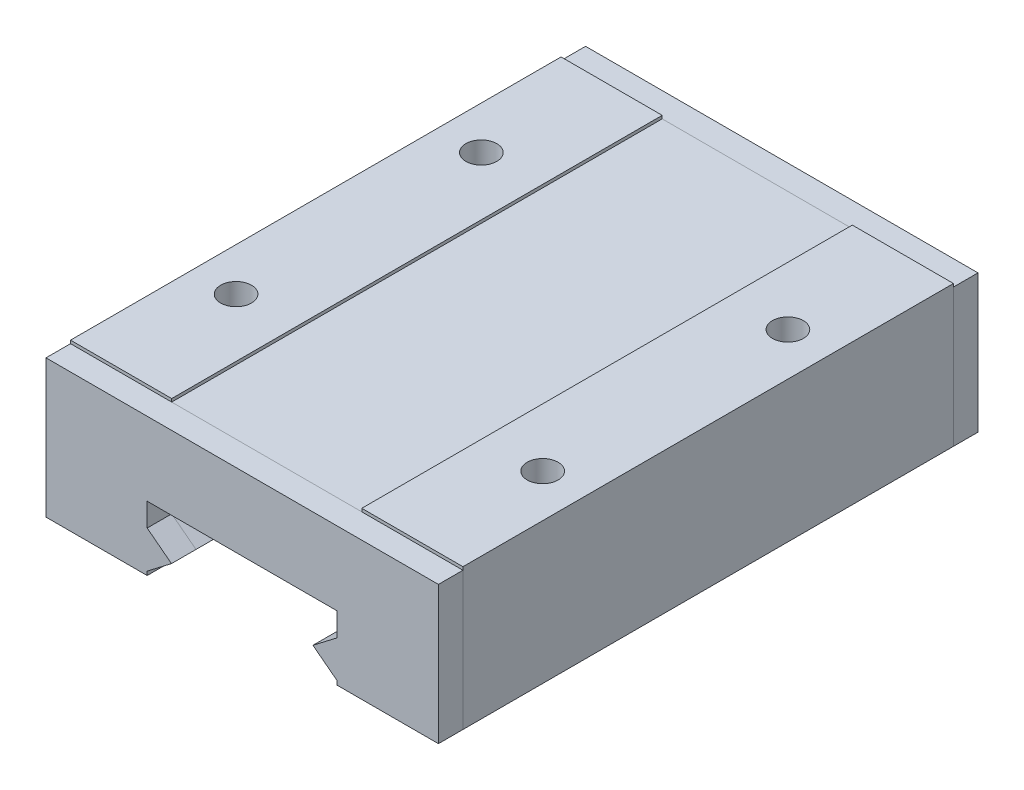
ISO-10303-21;
HEADER;
FILE_DESCRIPTION(('STEP AP214'),'2;1');
FILE_NAME('part.step','',(''),(''),'','','');
FILE_SCHEMA(('AUTOMOTIVE_DESIGN { 1 0 10303 214 1 1 1 1 }'));
ENDSEC;
DATA;
#1=APPLICATION_CONTEXT('core data for automotive mechanical design processes');
#2=APPLICATION_PROTOCOL_DEFINITION('international standard','automotive_design',2000,#1);
#3=PRODUCT_CONTEXT('',#1,'mechanical');
#4=PRODUCT('Part','Part','',(#3));
#5=PRODUCT_RELATED_PRODUCT_CATEGORY('part','',(#4));
#6=PRODUCT_DEFINITION_FORMATION('','',#4);
#7=PRODUCT_DEFINITION_CONTEXT('part definition',#1,'design');
#8=PRODUCT_DEFINITION('design','',#6,#7);
#9=PRODUCT_DEFINITION_SHAPE('','',#8);
#10=(LENGTH_UNIT() NAMED_UNIT(*) SI_UNIT(.MILLI.,.METRE.));
#11=(NAMED_UNIT(*) PLANE_ANGLE_UNIT() SI_UNIT($,.RADIAN.));
#12=(NAMED_UNIT(*) SI_UNIT($,.STERADIAN.) SOLID_ANGLE_UNIT());
#13=UNCERTAINTY_MEASURE_WITH_UNIT(LENGTH_MEASURE(1.E-05),#10,'distance_accuracy_value','');
#14=(GEOMETRIC_REPRESENTATION_CONTEXT(3) GLOBAL_UNCERTAINTY_ASSIGNED_CONTEXT((#13)) GLOBAL_UNIT_ASSIGNED_CONTEXT((#10,
#11,#12)) REPRESENTATION_CONTEXT('',''));
#15=CARTESIAN_POINT('',(0.,0.,0.));
#16=DIRECTION('',(0.,0.,1.));
#17=DIRECTION('',(1.,0.,0.));
#18=AXIS2_PLACEMENT_3D('',#15,#16,#17);
#19=CARTESIAN_POINT('',(-16.,15.75,13.9199425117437));
#20=DIRECTION('',(1.,0.,0.));
#21=DIRECTION('',(0.,0.,-1.));
#22=AXIS2_PLACEMENT_3D('',#19,#20,#21);
#23=PLANE('',#22);
#24=DIRECTION('',(0.,-1.,0.));
#25=VECTOR('',#24,1.);
#26=CARTESIAN_POINT('',(-16.,15.75,-20.));
#27=LINE('',#26,#25);
#28=CARTESIAN_POINT('',(-16.,15.75,-20.));
#29=VERTEX_POINT('',#28);
#30=CARTESIAN_POINT('',(-16.,4.5,-20.));
#31=VERTEX_POINT('',#30);
#32=EDGE_CURVE('E199',#29,#31,#27,.T.);
#33=ORIENTED_EDGE('',*,*,#32,.F.);
#34=DIRECTION('',(0.,0.,-1.));
#35=VECTOR('',#34,1.);
#36=CARTESIAN_POINT('',(-16.,15.75,13.9199425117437));
#37=LINE('',#36,#35);
#38=CARTESIAN_POINT('',(-16.,15.75,-22.));
#39=VERTEX_POINT('',#38);
#40=EDGE_CURVE('E50',#29,#39,#37,.T.);
#41=ORIENTED_EDGE('',*,*,#40,.T.);
#42=DIRECTION('',(0.,-1.,0.));
#43=VECTOR('',#42,1.);
#44=CARTESIAN_POINT('',(-16.,15.75,-22.));
#45=LINE('',#44,#43);
#46=CARTESIAN_POINT('',(-16.,4.5,-22.));
#47=VERTEX_POINT('',#46);
#48=EDGE_CURVE('E207',#39,#47,#45,.T.);
#49=ORIENTED_EDGE('',*,*,#48,.T.);
#50=DIRECTION('',(0.,0.,-1.));
#51=VECTOR('',#50,1.);
#52=CARTESIAN_POINT('',(-16.,4.5,13.9199425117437));
#53=LINE('',#52,#51);
#54=EDGE_CURVE('E125',#31,#47,#53,.T.);
#55=ORIENTED_EDGE('',*,*,#54,.F.);
#56=EDGE_LOOP('',(#33,#41,#49,#55));
#57=FACE_BOUND('',#56,.T.);
#58=ADVANCED_FACE('F46',(#57),#23,.F.);
#59=CARTESIAN_POINT('',(-16.,4.5,13.9199425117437));
#60=DIRECTION('',(0.,1.,0.));
#61=DIRECTION('',(0.,0.,1.));
#62=AXIS2_PLACEMENT_3D('',#59,#60,#61);
#63=PLANE('',#62);
#64=DIRECTION('',(1.,0.,0.));
#65=VECTOR('',#64,1.);
#66=CARTESIAN_POINT('',(-16.,4.5,-20.));
#67=LINE('',#66,#65);
#68=CARTESIAN_POINT('',(-7.75,4.5,-20.));
#69=VERTEX_POINT('',#68);
#70=EDGE_CURVE('E132',#31,#69,#67,.T.);
#71=ORIENTED_EDGE('',*,*,#70,.F.);
#72=ORIENTED_EDGE('',*,*,#54,.T.);
#73=DIRECTION('',(1.,0.,0.));
#74=VECTOR('',#73,1.);
#75=CARTESIAN_POINT('',(-16.,4.5,-22.));
#76=LINE('',#75,#74);
#77=CARTESIAN_POINT('',(-7.75,4.5,-22.));
#78=VERTEX_POINT('',#77);
#79=EDGE_CURVE('E206',#47,#78,#76,.T.);
#80=ORIENTED_EDGE('',*,*,#79,.T.);
#81=DIRECTION('',(0.,0.,-1.));
#82=VECTOR('',#81,1.);
#83=CARTESIAN_POINT('',(-7.75,4.5,13.9199425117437));
#84=LINE('',#83,#82);
#85=EDGE_CURVE('E208',#69,#78,#84,.T.);
#86=ORIENTED_EDGE('',*,*,#85,.F.);
#87=EDGE_LOOP('',(#71,#72,#80,#86));
#88=FACE_BOUND('',#87,.T.);
#89=ADVANCED_FACE('F267',(#88),#63,.F.);
#90=CARTESIAN_POINT('',(-7.75,4.5,13.9199425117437));
#91=DIRECTION('',(-1.,0.,0.));
#92=DIRECTION('',(0.,0.,1.));
#93=AXIS2_PLACEMENT_3D('',#90,#91,#92);
#94=PLANE('',#93);
#95=DIRECTION('',(0.,1.,0.));
#96=VECTOR('',#95,1.);
#97=CARTESIAN_POINT('',(-7.75,4.5,-20.));
#98=LINE('',#97,#96);
#99=CARTESIAN_POINT('',(-7.75,4.8123475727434,-20.));
#100=VERTEX_POINT('',#99);
#101=EDGE_CURVE('E195',#69,#100,#98,.T.);
#102=ORIENTED_EDGE('',*,*,#101,.F.);
#103=ORIENTED_EDGE('',*,*,#85,.T.);
#104=DIRECTION('',(0.,1.,0.));
#105=VECTOR('',#104,1.);
#106=CARTESIAN_POINT('',(-7.75,4.5,-22.));
#107=LINE('',#106,#105);
#108=CARTESIAN_POINT('',(-7.75,4.8123475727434,-22.));
#109=VERTEX_POINT('',#108);
#110=EDGE_CURVE('E210',#78,#109,#107,.T.);
#111=ORIENTED_EDGE('',*,*,#110,.T.);
#112=DIRECTION('',(0.,0.,-1.));
#113=VECTOR('',#112,1.);
#114=CARTESIAN_POINT('',(-7.75,4.8123475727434,13.9199425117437));
#115=LINE('',#114,#113);
#116=EDGE_CURVE('E211',#100,#109,#115,.T.);
#117=ORIENTED_EDGE('',*,*,#116,.F.);
#118=EDGE_LOOP('',(#102,#103,#111,#117));
#119=FACE_BOUND('',#118,.T.);
#120=ADVANCED_FACE('F270',(#119),#94,.F.);
#121=CARTESIAN_POINT('',(-7.75,4.8123475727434,13.9199425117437));
#122=DIRECTION('',(-0.608761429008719,0.793353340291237,0.));
#123=DIRECTION('',(-0.793353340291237,-0.608761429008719,0.));
#124=AXIS2_PLACEMENT_3D('',#121,#122,#123);
#125=PLANE('',#124);
#126=DIRECTION('',(0.793353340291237,0.608761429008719,0.));
#127=VECTOR('',#126,1.);
#128=CARTESIAN_POINT('',(-7.75,4.8123475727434,-20.));
#129=LINE('',#128,#127);
#130=CARTESIAN_POINT('',(-5.767812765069,6.33333333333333,-20.));
#131=VERTEX_POINT('',#130);
#132=EDGE_CURVE('E192',#100,#131,#129,.T.);
#133=ORIENTED_EDGE('',*,*,#132,.F.);
#134=ORIENTED_EDGE('',*,*,#116,.T.);
#135=DIRECTION('',(0.793353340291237,0.608761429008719,0.));
#136=VECTOR('',#135,1.);
#137=CARTESIAN_POINT('',(-7.75,4.8123475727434,-22.));
#138=LINE('',#137,#136);
#139=CARTESIAN_POINT('',(-5.767812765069,6.33333333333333,-22.));
#140=VERTEX_POINT('',#139);
#141=EDGE_CURVE('E213',#109,#140,#138,.T.);
#142=ORIENTED_EDGE('',*,*,#141,.T.);
#143=DIRECTION('',(0.,0.,-1.));
#144=VECTOR('',#143,1.);
#145=CARTESIAN_POINT('',(-5.767812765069,6.33333333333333,13.9199425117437));
#146=LINE('',#145,#144);
#147=EDGE_CURVE('E214',#131,#140,#146,.T.);
#148=ORIENTED_EDGE('',*,*,#147,.F.);
#149=EDGE_LOOP('',(#133,#134,#142,#148));
#150=FACE_BOUND('',#149,.T.);
#151=ADVANCED_FACE('F272',(#150),#125,.F.);
#152=CARTESIAN_POINT('',(-5.767812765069,6.33333333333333,13.9199425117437));
#153=DIRECTION('',(-0.608761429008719,-0.793353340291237,0.));
#154=DIRECTION('',(0.793353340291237,-0.608761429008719,0.));
#155=AXIS2_PLACEMENT_3D('',#152,#153,#154);
#156=PLANE('',#155);
#157=DIRECTION('',(-0.793353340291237,0.608761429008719,0.));
#158=VECTOR('',#157,1.);
#159=CARTESIAN_POINT('',(-5.767812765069,6.33333333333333,-20.));
#160=LINE('',#159,#158);
#161=CARTESIAN_POINT('',(-7.75,7.85431909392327,-20.));
#162=VERTEX_POINT('',#161);
#163=EDGE_CURVE('E189',#131,#162,#160,.T.);
#164=ORIENTED_EDGE('',*,*,#163,.F.);
#165=ORIENTED_EDGE('',*,*,#147,.T.);
#166=DIRECTION('',(-0.793353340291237,0.608761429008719,0.));
#167=VECTOR('',#166,1.);
#168=CARTESIAN_POINT('',(-5.767812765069,6.33333333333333,-22.));
#169=LINE('',#168,#167);
#170=CARTESIAN_POINT('',(-7.75,7.85431909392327,-22.));
#171=VERTEX_POINT('',#170);
#172=EDGE_CURVE('E216',#140,#171,#169,.T.);
#173=ORIENTED_EDGE('',*,*,#172,.T.);
#174=DIRECTION('',(0.,0.,-1.));
#175=VECTOR('',#174,1.);
#176=CARTESIAN_POINT('',(-7.75,7.85431909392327,13.9199425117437));
#177=LINE('',#176,#175);
#178=EDGE_CURVE('E217',#162,#171,#177,.T.);
#179=ORIENTED_EDGE('',*,*,#178,.F.);
#180=EDGE_LOOP('',(#164,#165,#173,#179));
#181=FACE_BOUND('',#180,.T.);
#182=ADVANCED_FACE('F276',(#181),#156,.F.);
#183=CARTESIAN_POINT('',(-7.75,7.85431909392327,13.9199425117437));
#184=DIRECTION('',(-1.,0.,0.));
#185=DIRECTION('',(0.,0.,1.));
#186=AXIS2_PLACEMENT_3D('',#183,#184,#185);
#187=PLANE('',#186);
#188=DIRECTION('',(0.,1.,0.));
#189=VECTOR('',#188,1.);
#190=CARTESIAN_POINT('',(-7.75,7.85431909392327,-20.));
#191=LINE('',#190,#189);
#192=CARTESIAN_POINT('',(-7.75,9.75,-20.));
#193=VERTEX_POINT('',#192);
#194=EDGE_CURVE('E186',#162,#193,#191,.T.);
#195=ORIENTED_EDGE('',*,*,#194,.F.);
#196=ORIENTED_EDGE('',*,*,#178,.T.);
#197=DIRECTION('',(0.,1.,0.));
#198=VECTOR('',#197,1.);
#199=CARTESIAN_POINT('',(-7.75,7.85431909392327,-22.));
#200=LINE('',#199,#198);
#201=CARTESIAN_POINT('',(-7.75,9.75,-22.));
#202=VERTEX_POINT('',#201);
#203=EDGE_CURVE('E219',#171,#202,#200,.T.);
#204=ORIENTED_EDGE('',*,*,#203,.T.);
#205=DIRECTION('',(0.,0.,-1.));
#206=VECTOR('',#205,1.);
#207=CARTESIAN_POINT('',(-7.75,9.75,13.9199425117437));
#208=LINE('',#207,#206);
#209=EDGE_CURVE('E220',#193,#202,#208,.T.);
#210=ORIENTED_EDGE('',*,*,#209,.F.);
#211=EDGE_LOOP('',(#195,#196,#204,#210));
#212=FACE_BOUND('',#211,.T.);
#213=ADVANCED_FACE('F281',(#212),#187,.F.);
#214=CARTESIAN_POINT('',(-7.75,9.75,13.9199425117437));
#215=DIRECTION('',(0.,1.,0.));
#216=DIRECTION('',(0.,0.,1.));
#217=AXIS2_PLACEMENT_3D('',#214,#215,#216);
#218=PLANE('',#217);
#219=DIRECTION('',(1.,0.,0.));
#220=VECTOR('',#219,1.);
#221=CARTESIAN_POINT('',(-7.75,9.75,-20.));
#222=LINE('',#221,#220);
#223=CARTESIAN_POINT('',(7.75,9.75,-20.));
#224=VERTEX_POINT('',#223);
#225=EDGE_CURVE('E183',#193,#224,#222,.T.);
#226=ORIENTED_EDGE('',*,*,#225,.F.);
#227=ORIENTED_EDGE('',*,*,#209,.T.);
#228=DIRECTION('',(1.,0.,0.));
#229=VECTOR('',#228,1.);
#230=CARTESIAN_POINT('',(-7.75,9.75,-22.));
#231=LINE('',#230,#229);
#232=CARTESIAN_POINT('',(7.75,9.75,-22.));
#233=VERTEX_POINT('',#232);
#234=EDGE_CURVE('E222',#202,#233,#231,.T.);
#235=ORIENTED_EDGE('',*,*,#234,.T.);
#236=DIRECTION('',(0.,0.,-1.));
#237=VECTOR('',#236,1.);
#238=CARTESIAN_POINT('',(7.75,9.75,13.9199425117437));
#239=LINE('',#238,#237);
#240=EDGE_CURVE('E223',#224,#233,#239,.T.);
#241=ORIENTED_EDGE('',*,*,#240,.F.);
#242=EDGE_LOOP('',(#226,#227,#235,#241));
#243=FACE_BOUND('',#242,.T.);
#244=ADVANCED_FACE('F284',(#243),#218,.F.);
#245=CARTESIAN_POINT('',(7.75,9.75,13.9199425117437));
#246=DIRECTION('',(1.,0.,0.));
#247=DIRECTION('',(0.,1.,0.));
#248=AXIS2_PLACEMENT_3D('',#245,#246,#247);
#249=PLANE('',#248);
#250=DIRECTION('',(0.,-1.,0.));
#251=VECTOR('',#250,1.);
#252=CARTESIAN_POINT('',(7.75,9.75,-20.));
#253=LINE('',#252,#251);
#254=CARTESIAN_POINT('',(7.75,7.85431909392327,-20.));
#255=VERTEX_POINT('',#254);
#256=EDGE_CURVE('E180',#224,#255,#253,.T.);
#257=ORIENTED_EDGE('',*,*,#256,.F.);
#258=ORIENTED_EDGE('',*,*,#240,.T.);
#259=DIRECTION('',(0.,-1.,0.));
#260=VECTOR('',#259,1.);
#261=CARTESIAN_POINT('',(7.75,9.75,-22.));
#262=LINE('',#261,#260);
#263=CARTESIAN_POINT('',(7.75,7.85431909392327,-22.));
#264=VERTEX_POINT('',#263);
#265=EDGE_CURVE('E225',#233,#264,#262,.T.);
#266=ORIENTED_EDGE('',*,*,#265,.T.);
#267=DIRECTION('',(0.,0.,-1.));
#268=VECTOR('',#267,1.);
#269=CARTESIAN_POINT('',(7.75,7.85431909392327,13.9199425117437));
#270=LINE('',#269,#268);
#271=EDGE_CURVE('E226',#255,#264,#270,.T.);
#272=ORIENTED_EDGE('',*,*,#271,.F.);
#273=EDGE_LOOP('',(#257,#258,#266,#272));
#274=FACE_BOUND('',#273,.T.);
#275=ADVANCED_FACE('F288',(#274),#249,.F.);
#276=CARTESIAN_POINT('',(7.75,7.85431909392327,13.9199425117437));
#277=DIRECTION('',(0.608761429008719,-0.793353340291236,0.));
#278=DIRECTION('',(0.793353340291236,0.608761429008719,0.));
#279=AXIS2_PLACEMENT_3D('',#276,#277,#278);
#280=PLANE('',#279);
#281=DIRECTION('',(-0.793353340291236,-0.608761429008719,0.));
#282=VECTOR('',#281,1.);
#283=CARTESIAN_POINT('',(7.75,7.85431909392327,-20.));
#284=LINE('',#283,#282);
#285=CARTESIAN_POINT('',(5.767812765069,6.33333333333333,-20.));
#286=VERTEX_POINT('',#285);
#287=EDGE_CURVE('E177',#255,#286,#284,.T.);
#288=ORIENTED_EDGE('',*,*,#287,.F.);
#289=ORIENTED_EDGE('',*,*,#271,.T.);
#290=DIRECTION('',(-0.793353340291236,-0.608761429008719,0.));
#291=VECTOR('',#290,1.);
#292=CARTESIAN_POINT('',(7.75,7.85431909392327,-22.));
#293=LINE('',#292,#291);
#294=CARTESIAN_POINT('',(5.767812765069,6.33333333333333,-22.));
#295=VERTEX_POINT('',#294);
#296=EDGE_CURVE('E228',#264,#295,#293,.T.);
#297=ORIENTED_EDGE('',*,*,#296,.T.);
#298=DIRECTION('',(0.,0.,-1.));
#299=VECTOR('',#298,1.);
#300=CARTESIAN_POINT('',(5.767812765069,6.33333333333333,13.9199425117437));
#301=LINE('',#300,#299);
#302=EDGE_CURVE('E229',#286,#295,#301,.T.);
#303=ORIENTED_EDGE('',*,*,#302,.F.);
#304=EDGE_LOOP('',(#288,#289,#297,#303));
#305=FACE_BOUND('',#304,.T.);
#306=ADVANCED_FACE('F293',(#305),#280,.F.);
#307=CARTESIAN_POINT('',(5.767812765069,6.33333333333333,13.9199425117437));
#308=DIRECTION('',(0.608761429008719,0.793353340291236,0.));
#309=DIRECTION('',(-0.793353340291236,0.608761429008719,0.));
#310=AXIS2_PLACEMENT_3D('',#307,#308,#309);
#311=PLANE('',#310);
#312=DIRECTION('',(0.793353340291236,-0.608761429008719,0.));
#313=VECTOR('',#312,1.);
#314=CARTESIAN_POINT('',(5.767812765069,6.33333333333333,-20.));
#315=LINE('',#314,#313);
#316=CARTESIAN_POINT('',(7.75,4.81234757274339,-20.));
#317=VERTEX_POINT('',#316);
#318=EDGE_CURVE('E172',#286,#317,#315,.T.);
#319=ORIENTED_EDGE('',*,*,#318,.F.);
#320=ORIENTED_EDGE('',*,*,#302,.T.);
#321=DIRECTION('',(0.793353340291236,-0.608761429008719,0.));
#322=VECTOR('',#321,1.);
#323=CARTESIAN_POINT('',(5.767812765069,6.33333333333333,-22.));
#324=LINE('',#323,#322);
#325=CARTESIAN_POINT('',(7.75,4.81234757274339,-22.));
#326=VERTEX_POINT('',#325);
#327=EDGE_CURVE('E231',#295,#326,#324,.T.);
#328=ORIENTED_EDGE('',*,*,#327,.T.);
#329=DIRECTION('',(0.,0.,-1.));
#330=VECTOR('',#329,1.);
#331=CARTESIAN_POINT('',(7.75,4.81234757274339,13.9199425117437));
#332=LINE('',#331,#330);
#333=EDGE_CURVE('E232',#317,#326,#332,.T.);
#334=ORIENTED_EDGE('',*,*,#333,.F.);
#335=EDGE_LOOP('',(#319,#320,#328,#334));
#336=FACE_BOUND('',#335,.T.);
#337=ADVANCED_FACE('F296',(#336),#311,.F.);
#338=CARTESIAN_POINT('',(7.75,4.81234757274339,13.9199425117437));
#339=DIRECTION('',(1.,0.,0.));
#340=DIRECTION('',(0.,0.,-1.));
#341=AXIS2_PLACEMENT_3D('',#338,#339,#340);
#342=PLANE('',#341);
#343=DIRECTION('',(0.,-1.,0.));
#344=VECTOR('',#343,1.);
#345=CARTESIAN_POINT('',(7.75,4.81234757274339,-20.));
#346=LINE('',#345,#344);
#347=CARTESIAN_POINT('',(7.75,4.5,-20.));
#348=VERTEX_POINT('',#347);
#349=EDGE_CURVE('E170',#317,#348,#346,.T.);
#350=ORIENTED_EDGE('',*,*,#349,.F.);
#351=ORIENTED_EDGE('',*,*,#333,.T.);
#352=DIRECTION('',(0.,-1.,0.));
#353=VECTOR('',#352,1.);
#354=CARTESIAN_POINT('',(7.75,4.81234757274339,-22.));
#355=LINE('',#354,#353);
#356=CARTESIAN_POINT('',(7.75,4.5,-22.));
#357=VERTEX_POINT('',#356);
#358=EDGE_CURVE('E234',#326,#357,#355,.T.);
#359=ORIENTED_EDGE('',*,*,#358,.T.);
#360=DIRECTION('',(0.,0.,-1.));
#361=VECTOR('',#360,1.);
#362=CARTESIAN_POINT('',(7.75,4.5,13.9199425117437));
#363=LINE('',#362,#361);
#364=EDGE_CURVE('E235',#348,#357,#363,.T.);
#365=ORIENTED_EDGE('',*,*,#364,.F.);
#366=EDGE_LOOP('',(#350,#351,#359,#365));
#367=FACE_BOUND('',#366,.T.);
#368=ADVANCED_FACE('F300',(#367),#342,.F.);
#369=CARTESIAN_POINT('',(7.75,4.5,13.9199425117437));
#370=DIRECTION('',(0.,1.,0.));
#371=DIRECTION('',(0.,0.,1.));
#372=AXIS2_PLACEMENT_3D('',#369,#370,#371);
#373=PLANE('',#372);
#374=DIRECTION('',(1.,0.,0.));
#375=VECTOR('',#374,1.);
#376=CARTESIAN_POINT('',(7.75,4.5,-20.));
#377=LINE('',#376,#375);
#378=CARTESIAN_POINT('',(16.,4.5,-20.));
#379=VERTEX_POINT('',#378);
#380=EDGE_CURVE('E55',#348,#379,#377,.T.);
#381=ORIENTED_EDGE('',*,*,#380,.F.);
#382=ORIENTED_EDGE('',*,*,#364,.T.);
#383=DIRECTION('',(1.,0.,0.));
#384=VECTOR('',#383,1.);
#385=CARTESIAN_POINT('',(7.75,4.5,-22.));
#386=LINE('',#385,#384);
#387=CARTESIAN_POINT('',(16.,4.5,-22.));
#388=VERTEX_POINT('',#387);
#389=EDGE_CURVE('E164',#357,#388,#386,.T.);
#390=ORIENTED_EDGE('',*,*,#389,.T.);
#391=DIRECTION('',(0.,0.,-1.));
#392=VECTOR('',#391,1.);
#393=CARTESIAN_POINT('',(16.,4.5,13.9199425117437));
#394=LINE('',#393,#392);
#395=EDGE_CURVE('E155',#379,#388,#394,.T.);
#396=ORIENTED_EDGE('',*,*,#395,.F.);
#397=EDGE_LOOP('',(#381,#382,#390,#396));
#398=FACE_BOUND('',#397,.T.);
#399=ADVANCED_FACE('F161',(#398),#373,.F.);
#400=CARTESIAN_POINT('',(16.,4.5,13.9199425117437));
#401=DIRECTION('',(-1.,0.,0.));
#402=DIRECTION('',(0.,0.,1.));
#403=AXIS2_PLACEMENT_3D('',#400,#401,#402);
#404=PLANE('',#403);
#405=DIRECTION('',(0.,1.,0.));
#406=VECTOR('',#405,1.);
#407=CARTESIAN_POINT('',(16.,4.5,-20.));
#408=LINE('',#407,#406);
#409=CARTESIAN_POINT('',(16.,15.75,-20.));
#410=VERTEX_POINT('',#409);
#411=EDGE_CURVE('E12',#379,#410,#408,.T.);
#412=ORIENTED_EDGE('',*,*,#411,.F.);
#413=ORIENTED_EDGE('',*,*,#395,.T.);
#414=DIRECTION('',(0.,1.,0.));
#415=VECTOR('',#414,1.);
#416=CARTESIAN_POINT('',(16.,4.5,-22.));
#417=LINE('',#416,#415);
#418=CARTESIAN_POINT('',(16.,15.75,-22.));
#419=VERTEX_POINT('',#418);
#420=EDGE_CURVE('E166',#388,#419,#417,.T.);
#421=ORIENTED_EDGE('',*,*,#420,.T.);
#422=DIRECTION('',(0.,0.,-1.));
#423=VECTOR('',#422,1.);
#424=CARTESIAN_POINT('',(16.,15.75,13.9199425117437));
#425=LINE('',#424,#423);
#426=EDGE_CURVE('E68',#410,#419,#425,.T.);
#427=ORIENTED_EDGE('',*,*,#426,.F.);
#428=EDGE_LOOP('',(#412,#413,#421,#427));
#429=FACE_BOUND('',#428,.T.);
#430=ADVANCED_FACE('F154',(#429),#404,.F.);
#431=CARTESIAN_POINT('',(16.,15.75,13.9199425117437));
#432=DIRECTION('',(0.,-1.,0.));
#433=DIRECTION('',(0.,0.,-1.));
#434=AXIS2_PLACEMENT_3D('',#431,#432,#433);
#435=PLANE('',#434);
#436=DIRECTION('',(-1.,0.,0.));
#437=VECTOR('',#436,1.);
#438=CARTESIAN_POINT('',(16.,15.75,-20.));
#439=LINE('',#438,#437);
#440=EDGE_CURVE('E202',#410,#29,#439,.T.);
#441=ORIENTED_EDGE('',*,*,#440,.F.);
#442=ORIENTED_EDGE('',*,*,#426,.T.);
#443=DIRECTION('',(-1.,0.,0.));
#444=VECTOR('',#443,1.);
#445=CARTESIAN_POINT('',(16.,15.75,-22.));
#446=LINE('',#445,#444);
#447=EDGE_CURVE('E204',#419,#39,#446,.T.);
#448=ORIENTED_EDGE('',*,*,#447,.T.);
#449=ORIENTED_EDGE('',*,*,#40,.F.);
#450=EDGE_LOOP('',(#441,#442,#448,#449));
#451=FACE_BOUND('',#450,.T.);
#452=ADVANCED_FACE('F262',(#451),#435,.F.);
#453=CARTESIAN_POINT('',(-16.,4.5,-22.));
#454=DIRECTION('',(0.,0.,1.));
#455=DIRECTION('',(1.,0.,0.));
#456=AXIS2_PLACEMENT_3D('',#453,#454,#455);
#457=PLANE('',#456);
#458=ORIENTED_EDGE('',*,*,#48,.F.);
#459=ORIENTED_EDGE('',*,*,#447,.F.);
#460=ORIENTED_EDGE('',*,*,#420,.F.);
#461=ORIENTED_EDGE('',*,*,#389,.F.);
#462=ORIENTED_EDGE('',*,*,#358,.F.);
#463=ORIENTED_EDGE('',*,*,#327,.F.);
#464=ORIENTED_EDGE('',*,*,#296,.F.);
#465=ORIENTED_EDGE('',*,*,#265,.F.);
#466=ORIENTED_EDGE('',*,*,#234,.F.);
#467=ORIENTED_EDGE('',*,*,#203,.F.);
#468=ORIENTED_EDGE('',*,*,#172,.F.);
#469=ORIENTED_EDGE('',*,*,#141,.F.);
#470=ORIENTED_EDGE('',*,*,#110,.F.);
#471=ORIENTED_EDGE('',*,*,#79,.F.);
#472=EDGE_LOOP('',(#458,#459,#460,#461,#462,#463,#464,#465,#466,#467,#468,#469,#470,#471));
#473=FACE_BOUND('',#472,.T.);
#474=ADVANCED_FACE('F264',(#473),#457,.F.);
#475=CARTESIAN_POINT('',(-16.,4.5,-20.));
#476=DIRECTION('',(0.,0.,1.));
#477=DIRECTION('',(1.,0.,0.));
#478=AXIS2_PLACEMENT_3D('',#475,#476,#477);
#479=PLANE('',#478);
#480=ORIENTED_EDGE('',*,*,#440,.T.);
#481=ORIENTED_EDGE('',*,*,#32,.T.);
#482=ORIENTED_EDGE('',*,*,#70,.T.);
#483=ORIENTED_EDGE('',*,*,#101,.T.);
#484=ORIENTED_EDGE('',*,*,#132,.T.);
#485=ORIENTED_EDGE('',*,*,#163,.T.);
#486=ORIENTED_EDGE('',*,*,#194,.T.);
#487=ORIENTED_EDGE('',*,*,#225,.T.);
#488=ORIENTED_EDGE('',*,*,#256,.T.);
#489=ORIENTED_EDGE('',*,*,#287,.T.);
#490=ORIENTED_EDGE('',*,*,#318,.T.);
#491=ORIENTED_EDGE('',*,*,#349,.T.);
#492=ORIENTED_EDGE('',*,*,#380,.T.);
#493=ORIENTED_EDGE('',*,*,#411,.T.);
#494=EDGE_LOOP('',(#480,#481,#482,#483,#484,#485,#486,#487,#488,#489,#490,#491,#492,#493));
#495=FACE_BOUND('',#494,.T.);
#496=ADVANCED_FACE('F48',(#495),#479,.T.);
#497=CLOSED_SHELL('',(#58,#89,#120,#151,#182,#213,#244,#275,#306,#337,#368,#399,#430,#452,#474,#496));
#498=MANIFOLD_SOLID_BREP('B2',#497);
#499=CARTESIAN_POINT('',(-16.,4.5,22.));
#500=DIRECTION('',(0.,1.,0.));
#501=DIRECTION('',(0.,0.,1.));
#502=AXIS2_PLACEMENT_3D('',#499,#500,#501);
#503=PLANE('',#502);
#504=DIRECTION('',(1.,0.,0.));
#505=VECTOR('',#504,1.);
#506=CARTESIAN_POINT('',(-16.,4.5,20.));
#507=LINE('',#506,#505);
#508=CARTESIAN_POINT('',(-16.,4.5,20.));
#509=VERTEX_POINT('',#508);
#510=CARTESIAN_POINT('',(-7.75,4.5,20.));
#511=VERTEX_POINT('',#510);
#512=EDGE_CURVE('E571',#509,#511,#507,.T.);
#513=ORIENTED_EDGE('',*,*,#512,.T.);
#514=DIRECTION('',(0.,0.,-1.));
#515=VECTOR('',#514,1.);
#516=CARTESIAN_POINT('',(-7.75,4.5,22.));
#517=LINE('',#516,#515);
#518=CARTESIAN_POINT('',(-7.75,4.5,22.));
#519=VERTEX_POINT('',#518);
#520=EDGE_CURVE('E44',#519,#511,#517,.T.);
#521=ORIENTED_EDGE('',*,*,#520,.F.);
#522=DIRECTION('',(1.,0.,0.));
#523=VECTOR('',#522,1.);
#524=CARTESIAN_POINT('',(-16.,4.5,22.));
#525=LINE('',#524,#523);
#526=CARTESIAN_POINT('',(-16.,4.5,22.));
#527=VERTEX_POINT('',#526);
#528=EDGE_CURVE('E597',#527,#519,#525,.T.);
#529=ORIENTED_EDGE('',*,*,#528,.F.);
#530=DIRECTION('',(0.,0.,-1.));
#531=VECTOR('',#530,1.);
#532=CARTESIAN_POINT('',(-16.,4.5,22.));
#533=LINE('',#532,#531);
#534=EDGE_CURVE('E567',#527,#509,#533,.T.);
#535=ORIENTED_EDGE('',*,*,#534,.T.);
#536=EDGE_LOOP('',(#513,#521,#529,#535));
#537=FACE_BOUND('',#536,.T.);
#538=ADVANCED_FACE('F439',(#537),#503,.F.);
#539=CARTESIAN_POINT('',(-7.75,4.5,22.));
#540=DIRECTION('',(-1.,0.,0.));
#541=DIRECTION('',(0.,0.,1.));
#542=AXIS2_PLACEMENT_3D('',#539,#540,#541);
#543=PLANE('',#542);
#544=DIRECTION('',(0.,1.,0.));
#545=VECTOR('',#544,1.);
#546=CARTESIAN_POINT('',(-7.75,4.5,20.));
#547=LINE('',#546,#545);
#548=CARTESIAN_POINT('',(-7.75,4.8123475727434,20.));
#549=VERTEX_POINT('',#548);
#550=EDGE_CURVE('E574',#511,#549,#547,.T.);
#551=ORIENTED_EDGE('',*,*,#550,.T.);
#552=DIRECTION('',(0.,0.,-1.));
#553=VECTOR('',#552,1.);
#554=CARTESIAN_POINT('',(-7.75,4.8123475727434,22.));
#555=LINE('',#554,#553);
#556=CARTESIAN_POINT('',(-7.75,4.8123475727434,22.));
#557=VERTEX_POINT('',#556);
#558=EDGE_CURVE('E447',#557,#549,#555,.T.);
#559=ORIENTED_EDGE('',*,*,#558,.F.);
#560=DIRECTION('',(0.,1.,0.));
#561=VECTOR('',#560,1.);
#562=CARTESIAN_POINT('',(-7.75,4.5,22.));
#563=LINE('',#562,#561);
#564=EDGE_CURVE('E516',#519,#557,#563,.T.);
#565=ORIENTED_EDGE('',*,*,#564,.F.);
#566=ORIENTED_EDGE('',*,*,#520,.T.);
#567=EDGE_LOOP('',(#551,#559,#565,#566));
#568=FACE_BOUND('',#567,.T.);
#569=ADVANCED_FACE('F685',(#568),#543,.F.);
#570=CARTESIAN_POINT('',(-7.75,4.8123475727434,22.));
#571=DIRECTION('',(-0.608761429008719,0.793353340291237,0.));
#572=DIRECTION('',(-0.793353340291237,-0.608761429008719,0.));
#573=AXIS2_PLACEMENT_3D('',#570,#571,#572);
#574=PLANE('',#573);
#575=DIRECTION('',(0.793353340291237,0.608761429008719,0.));
#576=VECTOR('',#575,1.);
#577=CARTESIAN_POINT('',(-7.75,4.8123475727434,20.));
#578=LINE('',#577,#576);
#579=CARTESIAN_POINT('',(-5.767812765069,6.33333333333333,20.));
#580=VERTEX_POINT('',#579);
#581=EDGE_CURVE('E576',#549,#580,#578,.T.);
#582=ORIENTED_EDGE('',*,*,#581,.T.);
#583=DIRECTION('',(0.,0.,-1.));
#584=VECTOR('',#583,1.);
#585=CARTESIAN_POINT('',(-5.767812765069,6.33333333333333,22.));
#586=LINE('',#585,#584);
#587=CARTESIAN_POINT('',(-5.767812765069,6.33333333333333,22.));
#588=VERTEX_POINT('',#587);
#589=EDGE_CURVE('E622',#588,#580,#586,.T.);
#590=ORIENTED_EDGE('',*,*,#589,.F.);
#591=DIRECTION('',(0.793353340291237,0.608761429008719,0.));
#592=VECTOR('',#591,1.);
#593=CARTESIAN_POINT('',(-7.75,4.8123475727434,22.));
#594=LINE('',#593,#592);
#595=EDGE_CURVE('E630',#557,#588,#594,.T.);
#596=ORIENTED_EDGE('',*,*,#595,.F.);
#597=ORIENTED_EDGE('',*,*,#558,.T.);
#598=EDGE_LOOP('',(#582,#590,#596,#597));
#599=FACE_BOUND('',#598,.T.);
#600=ADVANCED_FACE('F628',(#599),#574,.F.);
#601=CARTESIAN_POINT('',(-5.767812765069,6.33333333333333,22.));
#602=DIRECTION('',(-0.608761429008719,-0.793353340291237,0.));
#603=DIRECTION('',(0.793353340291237,-0.608761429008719,0.));
#604=AXIS2_PLACEMENT_3D('',#601,#602,#603);
#605=PLANE('',#604);
#606=DIRECTION('',(-0.793353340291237,0.608761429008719,0.));
#607=VECTOR('',#606,1.);
#608=CARTESIAN_POINT('',(-5.767812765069,6.33333333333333,20.));
#609=LINE('',#608,#607);
#610=CARTESIAN_POINT('',(-7.75,7.85431909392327,20.));
#611=VERTEX_POINT('',#610);
#612=EDGE_CURVE('E578',#580,#611,#609,.T.);
#613=ORIENTED_EDGE('',*,*,#612,.T.);
#614=DIRECTION('',(0.,0.,-1.));
#615=VECTOR('',#614,1.);
#616=CARTESIAN_POINT('',(-7.75,7.85431909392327,22.));
#617=LINE('',#616,#615);
#618=CARTESIAN_POINT('',(-7.75,7.85431909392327,22.));
#619=VERTEX_POINT('',#618);
#620=EDGE_CURVE('E619',#619,#611,#617,.T.);
#621=ORIENTED_EDGE('',*,*,#620,.F.);
#622=DIRECTION('',(-0.793353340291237,0.608761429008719,0.));
#623=VECTOR('',#622,1.);
#624=CARTESIAN_POINT('',(-5.767812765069,6.33333333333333,22.));
#625=LINE('',#624,#623);
#626=EDGE_CURVE('E648',#588,#619,#625,.T.);
#627=ORIENTED_EDGE('',*,*,#626,.F.);
#628=ORIENTED_EDGE('',*,*,#589,.T.);
#629=EDGE_LOOP('',(#613,#621,#627,#628));
#630=FACE_BOUND('',#629,.T.);
#631=ADVANCED_FACE('F639',(#630),#605,.F.);
#632=CARTESIAN_POINT('',(-7.75,7.85431909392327,22.));
#633=DIRECTION('',(-1.,0.,0.));
#634=DIRECTION('',(0.,0.,1.));
#635=AXIS2_PLACEMENT_3D('',#632,#633,#634);
#636=PLANE('',#635);
#637=DIRECTION('',(0.,1.,0.));
#638=VECTOR('',#637,1.);
#639=CARTESIAN_POINT('',(-7.75,7.85431909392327,20.));
#640=LINE('',#639,#638);
#641=CARTESIAN_POINT('',(-7.75,9.75,20.));
#642=VERTEX_POINT('',#641);
#643=EDGE_CURVE('E580',#611,#642,#640,.T.);
#644=ORIENTED_EDGE('',*,*,#643,.T.);
#645=DIRECTION('',(0.,0.,-1.));
#646=VECTOR('',#645,1.);
#647=CARTESIAN_POINT('',(-7.75,9.75,22.));
#648=LINE('',#647,#646);
#649=CARTESIAN_POINT('',(-7.75,9.75,22.));
#650=VERTEX_POINT('',#649);
#651=EDGE_CURVE('E616',#650,#642,#648,.T.);
#652=ORIENTED_EDGE('',*,*,#651,.F.);
#653=DIRECTION('',(0.,1.,0.));
#654=VECTOR('',#653,1.);
#655=CARTESIAN_POINT('',(-7.75,7.85431909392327,22.));
#656=LINE('',#655,#654);
#657=EDGE_CURVE('E645',#619,#650,#656,.T.);
#658=ORIENTED_EDGE('',*,*,#657,.F.);
#659=ORIENTED_EDGE('',*,*,#620,.T.);
#660=EDGE_LOOP('',(#644,#652,#658,#659));
#661=FACE_BOUND('',#660,.T.);
#662=ADVANCED_FACE('F643',(#661),#636,.F.);
#663=CARTESIAN_POINT('',(-7.75,9.75,22.));
#664=DIRECTION('',(0.,1.,0.));
#665=DIRECTION('',(0.,0.,1.));
#666=AXIS2_PLACEMENT_3D('',#663,#664,#665);
#667=PLANE('',#666);
#668=DIRECTION('',(1.,0.,0.));
#669=VECTOR('',#668,1.);
#670=CARTESIAN_POINT('',(-7.75,9.75,20.));
#671=LINE('',#670,#669);
#672=CARTESIAN_POINT('',(7.75,9.75,20.));
#673=VERTEX_POINT('',#672);
#674=EDGE_CURVE('E582',#642,#673,#671,.T.);
#675=ORIENTED_EDGE('',*,*,#674,.T.);
#676=DIRECTION('',(0.,0.,-1.));
#677=VECTOR('',#676,1.);
#678=CARTESIAN_POINT('',(7.75,9.75,22.));
#679=LINE('',#678,#677);
#680=CARTESIAN_POINT('',(7.75,9.75,22.));
#681=VERTEX_POINT('',#680);
#682=EDGE_CURVE('E613',#681,#673,#679,.T.);
#683=ORIENTED_EDGE('',*,*,#682,.F.);
#684=DIRECTION('',(1.,0.,0.));
#685=VECTOR('',#684,1.);
#686=CARTESIAN_POINT('',(-7.75,9.75,22.));
#687=LINE('',#686,#685);
#688=EDGE_CURVE('E647',#650,#681,#687,.T.);
#689=ORIENTED_EDGE('',*,*,#688,.F.);
#690=ORIENTED_EDGE('',*,*,#651,.T.);
#691=EDGE_LOOP('',(#675,#683,#689,#690));
#692=FACE_BOUND('',#691,.T.);
#693=ADVANCED_FACE('F698',(#692),#667,.F.);
#694=CARTESIAN_POINT('',(7.75,9.75,22.));
#695=DIRECTION('',(1.,0.,0.));
#696=DIRECTION('',(0.,1.,0.));
#697=AXIS2_PLACEMENT_3D('',#694,#695,#696);
#698=PLANE('',#697);
#699=DIRECTION('',(0.,-1.,0.));
#700=VECTOR('',#699,1.);
#701=CARTESIAN_POINT('',(7.75,9.75,20.));
#702=LINE('',#701,#700);
#703=CARTESIAN_POINT('',(7.75,7.85431909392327,20.));
#704=VERTEX_POINT('',#703);
#705=EDGE_CURVE('E584',#673,#704,#702,.T.);
#706=ORIENTED_EDGE('',*,*,#705,.T.);
#707=DIRECTION('',(0.,0.,-1.));
#708=VECTOR('',#707,1.);
#709=CARTESIAN_POINT('',(7.75,7.85431909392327,22.));
#710=LINE('',#709,#708);
#711=CARTESIAN_POINT('',(7.75,7.85431909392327,22.));
#712=VERTEX_POINT('',#711);
#713=EDGE_CURVE('E610',#712,#704,#710,.T.);
#714=ORIENTED_EDGE('',*,*,#713,.F.);
#715=DIRECTION('',(0.,-1.,0.));
#716=VECTOR('',#715,1.);
#717=CARTESIAN_POINT('',(7.75,9.75,22.));
#718=LINE('',#717,#716);
#719=EDGE_CURVE('E650',#681,#712,#718,.T.);
#720=ORIENTED_EDGE('',*,*,#719,.F.);
#721=ORIENTED_EDGE('',*,*,#682,.T.);
#722=EDGE_LOOP('',(#706,#714,#720,#721));
#723=FACE_BOUND('',#722,.T.);
#724=ADVANCED_FACE('F701',(#723),#698,.F.);
#725=CARTESIAN_POINT('',(7.75,7.85431909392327,22.));
#726=DIRECTION('',(0.608761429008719,-0.793353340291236,0.));
#727=DIRECTION('',(0.793353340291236,0.608761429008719,0.));
#728=AXIS2_PLACEMENT_3D('',#725,#726,#727);
#729=PLANE('',#728);
#730=DIRECTION('',(-0.793353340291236,-0.608761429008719,0.));
#731=VECTOR('',#730,1.);
#732=CARTESIAN_POINT('',(7.75,7.85431909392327,20.));
#733=LINE('',#732,#731);
#734=CARTESIAN_POINT('',(5.767812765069,6.33333333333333,20.));
#735=VERTEX_POINT('',#734);
#736=EDGE_CURVE('E586',#704,#735,#733,.T.);
#737=ORIENTED_EDGE('',*,*,#736,.T.);
#738=DIRECTION('',(0.,0.,-1.));
#739=VECTOR('',#738,1.);
#740=CARTESIAN_POINT('',(5.767812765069,6.33333333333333,22.));
#741=LINE('',#740,#739);
#742=CARTESIAN_POINT('',(5.767812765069,6.33333333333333,22.));
#743=VERTEX_POINT('',#742);
#744=EDGE_CURVE('E607',#743,#735,#741,.T.);
#745=ORIENTED_EDGE('',*,*,#744,.F.);
#746=DIRECTION('',(-0.793353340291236,-0.608761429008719,0.));
#747=VECTOR('',#746,1.);
#748=CARTESIAN_POINT('',(7.75,7.85431909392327,22.));
#749=LINE('',#748,#747);
#750=EDGE_CURVE('E656',#712,#743,#749,.T.);
#751=ORIENTED_EDGE('',*,*,#750,.F.);
#752=ORIENTED_EDGE('',*,*,#713,.T.);
#753=EDGE_LOOP('',(#737,#745,#751,#752));
#754=FACE_BOUND('',#753,.T.);
#755=ADVANCED_FACE('F705',(#754),#729,.F.);
#756=CARTESIAN_POINT('',(5.767812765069,6.33333333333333,22.));
#757=DIRECTION('',(0.608761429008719,0.793353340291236,0.));
#758=DIRECTION('',(-0.793353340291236,0.608761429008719,0.));
#759=AXIS2_PLACEMENT_3D('',#756,#757,#758);
#760=PLANE('',#759);
#761=DIRECTION('',(0.793353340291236,-0.608761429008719,0.));
#762=VECTOR('',#761,1.);
#763=CARTESIAN_POINT('',(5.767812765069,6.33333333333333,20.));
#764=LINE('',#763,#762);
#765=CARTESIAN_POINT('',(7.75,4.81234757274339,20.));
#766=VERTEX_POINT('',#765);
#767=EDGE_CURVE('E588',#735,#766,#764,.T.);
#768=ORIENTED_EDGE('',*,*,#767,.T.);
#769=DIRECTION('',(0.,0.,-1.));
#770=VECTOR('',#769,1.);
#771=CARTESIAN_POINT('',(7.75,4.81234757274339,22.));
#772=LINE('',#771,#770);
#773=CARTESIAN_POINT('',(7.75,4.81234757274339,22.));
#774=VERTEX_POINT('',#773);
#775=EDGE_CURVE('E604',#774,#766,#772,.T.);
#776=ORIENTED_EDGE('',*,*,#775,.F.);
#777=DIRECTION('',(0.793353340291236,-0.608761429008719,0.));
#778=VECTOR('',#777,1.);
#779=CARTESIAN_POINT('',(5.767812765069,6.33333333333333,22.));
#780=LINE('',#779,#778);
#781=EDGE_CURVE('E658',#743,#774,#780,.T.);
#782=ORIENTED_EDGE('',*,*,#781,.F.);
#783=ORIENTED_EDGE('',*,*,#744,.T.);
#784=EDGE_LOOP('',(#768,#776,#782,#783));
#785=FACE_BOUND('',#784,.T.);
#786=ADVANCED_FACE('F709',(#785),#760,.F.);
#787=CARTESIAN_POINT('',(7.75,4.81234757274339,22.));
#788=DIRECTION('',(1.,0.,0.));
#789=DIRECTION('',(0.,0.,-1.));
#790=AXIS2_PLACEMENT_3D('',#787,#788,#789);
#791=PLANE('',#790);
#792=DIRECTION('',(0.,-1.,0.));
#793=VECTOR('',#792,1.);
#794=CARTESIAN_POINT('',(7.75,4.81234757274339,20.));
#795=LINE('',#794,#793);
#796=CARTESIAN_POINT('',(7.75,4.5,20.));
#797=VERTEX_POINT('',#796);
#798=EDGE_CURVE('E590',#766,#797,#795,.T.);
#799=ORIENTED_EDGE('',*,*,#798,.T.);
#800=DIRECTION('',(0.,0.,-1.));
#801=VECTOR('',#800,1.);
#802=CARTESIAN_POINT('',(7.75,4.5,22.));
#803=LINE('',#802,#801);
#804=CARTESIAN_POINT('',(7.75,4.5,22.));
#805=VERTEX_POINT('',#804);
#806=EDGE_CURVE('E601',#805,#797,#803,.T.);
#807=ORIENTED_EDGE('',*,*,#806,.F.);
#808=DIRECTION('',(0.,-1.,0.));
#809=VECTOR('',#808,1.);
#810=CARTESIAN_POINT('',(7.75,4.81234757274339,22.));
#811=LINE('',#810,#809);
#812=EDGE_CURVE('E660',#774,#805,#811,.T.);
#813=ORIENTED_EDGE('',*,*,#812,.F.);
#814=ORIENTED_EDGE('',*,*,#775,.T.);
#815=EDGE_LOOP('',(#799,#807,#813,#814));
#816=FACE_BOUND('',#815,.T.);
#817=ADVANCED_FACE('F666',(#816),#791,.F.);
#818=CARTESIAN_POINT('',(7.75,4.5,22.));
#819=DIRECTION('',(0.,1.,0.));
#820=DIRECTION('',(0.,0.,1.));
#821=AXIS2_PLACEMENT_3D('',#818,#819,#820);
#822=PLANE('',#821);
#823=DIRECTION('',(1.,0.,0.));
#824=VECTOR('',#823,1.);
#825=CARTESIAN_POINT('',(7.75,4.5,20.));
#826=LINE('',#825,#824);
#827=CARTESIAN_POINT('',(16.,4.5,20.));
#828=VERTEX_POINT('',#827);
#829=EDGE_CURVE('E592',#797,#828,#826,.T.);
#830=ORIENTED_EDGE('',*,*,#829,.T.);
#831=DIRECTION('',(0.,0.,-1.));
#832=VECTOR('',#831,1.);
#833=CARTESIAN_POINT('',(16.,4.5,22.));
#834=LINE('',#833,#832);
#835=CARTESIAN_POINT('',(16.,4.5,22.));
#836=VERTEX_POINT('',#835);
#837=EDGE_CURVE('E562',#836,#828,#834,.T.);
#838=ORIENTED_EDGE('',*,*,#837,.F.);
#839=DIRECTION('',(1.,0.,0.));
#840=VECTOR('',#839,1.);
#841=CARTESIAN_POINT('',(7.75,4.5,22.));
#842=LINE('',#841,#840);
#843=EDGE_CURVE('E553',#805,#836,#842,.T.);
#844=ORIENTED_EDGE('',*,*,#843,.F.);
#845=ORIENTED_EDGE('',*,*,#806,.T.);
#846=EDGE_LOOP('',(#830,#838,#844,#845));
#847=FACE_BOUND('',#846,.T.);
#848=ADVANCED_FACE('F670',(#847),#822,.F.);
#849=CARTESIAN_POINT('',(16.,4.5,22.));
#850=DIRECTION('',(-1.,0.,0.));
#851=DIRECTION('',(0.,0.,1.));
#852=AXIS2_PLACEMENT_3D('',#849,#850,#851);
#853=PLANE('',#852);
#854=DIRECTION('',(0.,1.,0.));
#855=VECTOR('',#854,1.);
#856=CARTESIAN_POINT('',(16.,4.5,20.));
#857=LINE('',#856,#855);
#858=CARTESIAN_POINT('',(16.,15.75,20.));
#859=VERTEX_POINT('',#858);
#860=EDGE_CURVE('E561',#828,#859,#857,.T.);
#861=ORIENTED_EDGE('',*,*,#860,.T.);
#862=DIRECTION('',(0.,0.,-1.));
#863=VECTOR('',#862,1.);
#864=CARTESIAN_POINT('',(16.,15.75,22.));
#865=LINE('',#864,#863);
#866=CARTESIAN_POINT('',(16.,15.75,22.));
#867=VERTEX_POINT('',#866);
#868=EDGE_CURVE('E558',#867,#859,#865,.T.);
#869=ORIENTED_EDGE('',*,*,#868,.F.);
#870=DIRECTION('',(0.,1.,0.));
#871=VECTOR('',#870,1.);
#872=CARTESIAN_POINT('',(16.,4.5,22.));
#873=LINE('',#872,#871);
#874=EDGE_CURVE('E547',#836,#867,#873,.T.);
#875=ORIENTED_EDGE('',*,*,#874,.F.);
#876=ORIENTED_EDGE('',*,*,#837,.T.);
#877=EDGE_LOOP('',(#861,#869,#875,#876));
#878=FACE_BOUND('',#877,.T.);
#879=ADVANCED_FACE('F559',(#878),#853,.F.);
#880=CARTESIAN_POINT('',(-16.,15.75,22.));
#881=DIRECTION('',(0.,-1.,0.));
#882=DIRECTION('',(0.,0.,-1.));
#883=AXIS2_PLACEMENT_3D('',#880,#881,#882);
#884=PLANE('',#883);
#885=DIRECTION('',(-1.,0.,0.));
#886=VECTOR('',#885,1.);
#887=CARTESIAN_POINT('',(-16.,15.75,20.));
#888=LINE('',#887,#886);
#889=CARTESIAN_POINT('',(-16.,15.75,20.));
#890=VERTEX_POINT('',#889);
#891=EDGE_CURVE('E502',#859,#890,#888,.T.);
#892=ORIENTED_EDGE('',*,*,#891,.T.);
#893=DIRECTION('',(0.,0.,-1.));
#894=VECTOR('',#893,1.);
#895=CARTESIAN_POINT('',(-16.,15.75,22.));
#896=LINE('',#895,#894);
#897=CARTESIAN_POINT('',(-16.,15.75,22.));
#898=VERTEX_POINT('',#897);
#899=EDGE_CURVE('E563',#898,#890,#896,.T.);
#900=ORIENTED_EDGE('',*,*,#899,.F.);
#901=DIRECTION('',(-1.,0.,0.));
#902=VECTOR('',#901,1.);
#903=CARTESIAN_POINT('',(-16.,15.75,22.));
#904=LINE('',#903,#902);
#905=EDGE_CURVE('E551',#867,#898,#904,.T.);
#906=ORIENTED_EDGE('',*,*,#905,.F.);
#907=ORIENTED_EDGE('',*,*,#868,.T.);
#908=EDGE_LOOP('',(#892,#900,#906,#907));
#909=FACE_BOUND('',#908,.T.);
#910=ADVANCED_FACE('F565',(#909),#884,.F.);
#911=CARTESIAN_POINT('',(-16.,15.75,22.));
#912=DIRECTION('',(1.,0.,0.));
#913=DIRECTION('',(0.,0.,-1.));
#914=AXIS2_PLACEMENT_3D('',#911,#912,#913);
#915=PLANE('',#914);
#916=DIRECTION('',(0.,-1.,0.));
#917=VECTOR('',#916,1.);
#918=CARTESIAN_POINT('',(-16.,15.75,20.));
#919=LINE('',#918,#917);
#920=EDGE_CURVE('E508',#890,#509,#919,.T.);
#921=ORIENTED_EDGE('',*,*,#920,.T.);
#922=ORIENTED_EDGE('',*,*,#534,.F.);
#923=DIRECTION('',(0.,-1.,0.));
#924=VECTOR('',#923,1.);
#925=CARTESIAN_POINT('',(-16.,15.75,22.));
#926=LINE('',#925,#924);
#927=EDGE_CURVE('E455',#898,#527,#926,.T.);
#928=ORIENTED_EDGE('',*,*,#927,.F.);
#929=ORIENTED_EDGE('',*,*,#899,.T.);
#930=EDGE_LOOP('',(#921,#922,#928,#929));
#931=FACE_BOUND('',#930,.T.);
#932=ADVANCED_FACE('F674',(#931),#915,.F.);
#933=CARTESIAN_POINT('',(-7.75,4.5,22.));
#934=DIRECTION('',(0.,0.,1.));
#935=DIRECTION('',(1.,0.,0.));
#936=AXIS2_PLACEMENT_3D('',#933,#934,#935);
#937=PLANE('',#936);
#938=ORIENTED_EDGE('',*,*,#528,.T.);
#939=ORIENTED_EDGE('',*,*,#564,.T.);
#940=ORIENTED_EDGE('',*,*,#595,.T.);
#941=ORIENTED_EDGE('',*,*,#626,.T.);
#942=ORIENTED_EDGE('',*,*,#657,.T.);
#943=ORIENTED_EDGE('',*,*,#688,.T.);
#944=ORIENTED_EDGE('',*,*,#719,.T.);
#945=ORIENTED_EDGE('',*,*,#750,.T.);
#946=ORIENTED_EDGE('',*,*,#781,.T.);
#947=ORIENTED_EDGE('',*,*,#812,.T.);
#948=ORIENTED_EDGE('',*,*,#843,.T.);
#949=ORIENTED_EDGE('',*,*,#874,.T.);
#950=ORIENTED_EDGE('',*,*,#905,.T.);
#951=ORIENTED_EDGE('',*,*,#927,.T.);
#952=EDGE_LOOP('',(#938,#939,#940,#941,#942,#943,#944,#945,#946,#947,#948,#949,#950,#951));
#953=FACE_BOUND('',#952,.T.);
#954=ADVANCED_FACE('F549',(#953),#937,.T.);
#955=CARTESIAN_POINT('',(-7.75,4.5,20.));
#956=DIRECTION('',(0.,0.,1.));
#957=DIRECTION('',(1.,0.,0.));
#958=AXIS2_PLACEMENT_3D('',#955,#956,#957);
#959=PLANE('',#958);
#960=ORIENTED_EDGE('',*,*,#512,.F.);
#961=ORIENTED_EDGE('',*,*,#920,.F.);
#962=ORIENTED_EDGE('',*,*,#891,.F.);
#963=ORIENTED_EDGE('',*,*,#860,.F.);
#964=ORIENTED_EDGE('',*,*,#829,.F.);
#965=ORIENTED_EDGE('',*,*,#798,.F.);
#966=ORIENTED_EDGE('',*,*,#767,.F.);
#967=ORIENTED_EDGE('',*,*,#736,.F.);
#968=ORIENTED_EDGE('',*,*,#705,.F.);
#969=ORIENTED_EDGE('',*,*,#674,.F.);
#970=ORIENTED_EDGE('',*,*,#643,.F.);
#971=ORIENTED_EDGE('',*,*,#612,.F.);
#972=ORIENTED_EDGE('',*,*,#581,.F.);
#973=ORIENTED_EDGE('',*,*,#550,.F.);
#974=EDGE_LOOP('',(#960,#961,#962,#963,#964,#965,#966,#967,#968,#969,#970,#971,#972,#973));
#975=FACE_BOUND('',#974,.T.);
#976=ADVANCED_FACE('F634',(#975),#959,.F.);
#977=CLOSED_SHELL('',(#538,#569,#600,#631,#662,#693,#724,#755,#786,#817,#848,#879,#910,#932,
#954,#976));
#978=MANIFOLD_SOLID_BREP('B6',#977);
#979=CARTESIAN_POINT('',(-16.,16.,20.));
#980=DIRECTION('',(1.,0.,0.));
#981=DIRECTION('',(0.,0.,-1.));
#982=AXIS2_PLACEMENT_3D('',#979,#980,#981);
#983=PLANE('',#982);
#984=DIRECTION('',(0.,-1.,0.));
#985=VECTOR('',#984,1.);
#986=CARTESIAN_POINT('',(-16.,16.,-20.));
#987=LINE('',#986,#985);
#988=CARTESIAN_POINT('',(-16.,16.,-20.));
#989=VERTEX_POINT('',#988);
#990=CARTESIAN_POINT('',(-16.,4.5,-20.));
#991=VERTEX_POINT('',#990);
#992=EDGE_CURVE('E979',#989,#991,#987,.T.);
#993=ORIENTED_EDGE('',*,*,#992,.T.);
#994=DIRECTION('',(0.,0.,-1.));
#995=VECTOR('',#994,1.);
#996=CARTESIAN_POINT('',(-16.,4.5,20.));
#997=LINE('',#996,#995);
#998=CARTESIAN_POINT('',(-16.,4.5,20.));
#999=VERTEX_POINT('',#998);
#1000=EDGE_CURVE('E437',#999,#991,#997,.T.);
#1001=ORIENTED_EDGE('',*,*,#1000,.F.);
#1002=DIRECTION('',(0.,-1.,0.));
#1003=VECTOR('',#1002,1.);
#1004=CARTESIAN_POINT('',(-16.,16.,20.));
#1005=LINE('',#1004,#1003);
#1006=CARTESIAN_POINT('',(-16.,16.,20.));
#1007=VERTEX_POINT('',#1006);
#1008=EDGE_CURVE('E1014',#1007,#999,#1005,.T.);
#1009=ORIENTED_EDGE('',*,*,#1008,.F.);
#1010=DIRECTION('',(0.,0.,-1.));
#1011=VECTOR('',#1010,1.);
#1012=CARTESIAN_POINT('',(-16.,16.,20.));
#1013=LINE('',#1012,#1011);
#1014=EDGE_CURVE('E975',#1007,#989,#1013,.T.);
#1015=ORIENTED_EDGE('',*,*,#1014,.T.);
#1016=EDGE_LOOP('',(#993,#1001,#1009,#1015));
#1017=FACE_BOUND('',#1016,.T.);
#1018=ADVANCED_FACE('F823',(#1017),#983,.F.);
#1019=CARTESIAN_POINT('',(-16.,4.5,20.));
#1020=DIRECTION('',(0.,1.,0.));
#1021=DIRECTION('',(0.,0.,1.));
#1022=AXIS2_PLACEMENT_3D('',#1019,#1020,#1021);
#1023=PLANE('',#1022);
#1024=DIRECTION('',(1.,0.,0.));
#1025=VECTOR('',#1024,1.);
#1026=CARTESIAN_POINT('',(-16.,4.5,-20.));
#1027=LINE('',#1026,#1025);
#1028=CARTESIAN_POINT('',(-7.75,4.5,-20.));
#1029=VERTEX_POINT('',#1028);
#1030=EDGE_CURVE('E982',#991,#1029,#1027,.T.);
#1031=ORIENTED_EDGE('',*,*,#1030,.T.);
#1032=DIRECTION('',(0.,0.,-1.));
#1033=VECTOR('',#1032,1.);
#1034=CARTESIAN_POINT('',(-7.75,4.5,20.));
#1035=LINE('',#1034,#1033);
#1036=CARTESIAN_POINT('',(-7.75,4.5,20.));
#1037=VERTEX_POINT('',#1036);
#1038=EDGE_CURVE('E831',#1037,#1029,#1035,.T.);
#1039=ORIENTED_EDGE('',*,*,#1038,.F.);
#1040=DIRECTION('',(1.,0.,0.));
#1041=VECTOR('',#1040,1.);
#1042=CARTESIAN_POINT('',(-16.,4.5,20.));
#1043=LINE('',#1042,#1041);
#1044=EDGE_CURVE('E912',#999,#1037,#1043,.T.);
#1045=ORIENTED_EDGE('',*,*,#1044,.F.);
#1046=ORIENTED_EDGE('',*,*,#1000,.T.);
#1047=EDGE_LOOP('',(#1031,#1039,#1045,#1046));
#1048=FACE_BOUND('',#1047,.T.);
#1049=ADVANCED_FACE('F1125',(#1048),#1023,.F.);
#1050=CARTESIAN_POINT('',(-7.75,4.5,20.));
#1051=DIRECTION('',(-1.,0.,0.));
#1052=DIRECTION('',(0.,0.,1.));
#1053=AXIS2_PLACEMENT_3D('',#1050,#1051,#1052);
#1054=PLANE('',#1053);
#1055=DIRECTION('',(0.,1.,0.));
#1056=VECTOR('',#1055,1.);
#1057=CARTESIAN_POINT('',(-7.75,4.5,-20.));
#1058=LINE('',#1057,#1056);
#1059=CARTESIAN_POINT('',(-7.75,4.8123475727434,-20.));
#1060=VERTEX_POINT('',#1059);
#1061=EDGE_CURVE('E985',#1029,#1060,#1058,.T.);
#1062=ORIENTED_EDGE('',*,*,#1061,.T.);
#1063=DIRECTION('',(0.,0.,-1.));
#1064=VECTOR('',#1063,1.);
#1065=CARTESIAN_POINT('',(-7.75,4.8123475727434,20.));
#1066=LINE('',#1065,#1064);
#1067=CARTESIAN_POINT('',(-7.75,4.8123475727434,20.));
#1068=VERTEX_POINT('',#1067);
#1069=EDGE_CURVE('E1051',#1068,#1060,#1066,.T.);
#1070=ORIENTED_EDGE('',*,*,#1069,.F.);
#1071=DIRECTION('',(0.,1.,0.));
#1072=VECTOR('',#1071,1.);
#1073=CARTESIAN_POINT('',(-7.75,4.5,20.));
#1074=LINE('',#1073,#1072);
#1075=EDGE_CURVE('E1059',#1037,#1068,#1074,.T.);
#1076=ORIENTED_EDGE('',*,*,#1075,.F.);
#1077=ORIENTED_EDGE('',*,*,#1038,.T.);
#1078=EDGE_LOOP('',(#1062,#1070,#1076,#1077));
#1079=FACE_BOUND('',#1078,.T.);
#1080=ADVANCED_FACE('F1057',(#1079),#1054,.F.);
#1081=CARTESIAN_POINT('',(-5.767812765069,6.33333333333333,20.));
#1082=DIRECTION('',(-0.608761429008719,0.793353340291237,0.));
#1083=DIRECTION('',(-0.793353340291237,-0.608761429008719,0.));
#1084=AXIS2_PLACEMENT_3D('',#1081,#1082,#1083);
#1085=PLANE('',#1084);
#1086=DIRECTION('',(0.793353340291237,0.608761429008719,0.));
#1087=VECTOR('',#1086,1.);
#1088=CARTESIAN_POINT('',(-5.767812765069,6.33333333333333,-20.));
#1089=LINE('',#1088,#1087);
#1090=CARTESIAN_POINT('',(-5.767812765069,6.33333333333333,-20.));
#1091=VERTEX_POINT('',#1090);
#1092=EDGE_CURVE('E987',#1060,#1091,#1089,.T.);
#1093=ORIENTED_EDGE('',*,*,#1092,.T.);
#1094=DIRECTION('',(0.,0.,-1.));
#1095=VECTOR('',#1094,1.);
#1096=CARTESIAN_POINT('',(-5.767812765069,6.33333333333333,20.));
#1097=LINE('',#1096,#1095);
#1098=CARTESIAN_POINT('',(-5.767812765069,6.33333333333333,20.));
#1099=VERTEX_POINT('',#1098);
#1100=EDGE_CURVE('E1048',#1099,#1091,#1097,.T.);
#1101=ORIENTED_EDGE('',*,*,#1100,.F.);
#1102=DIRECTION('',(0.793353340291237,0.608761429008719,0.));
#1103=VECTOR('',#1102,1.);
#1104=CARTESIAN_POINT('',(-5.767812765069,6.33333333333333,20.));
#1105=LINE('',#1104,#1103);
#1106=EDGE_CURVE('E1077',#1068,#1099,#1105,.T.);
#1107=ORIENTED_EDGE('',*,*,#1106,.F.);
#1108=ORIENTED_EDGE('',*,*,#1069,.T.);
#1109=EDGE_LOOP('',(#1093,#1101,#1107,#1108));
#1110=FACE_BOUND('',#1109,.T.);
#1111=ADVANCED_FACE('F1068',(#1110),#1085,.F.);
#1112=CARTESIAN_POINT('',(-7.75,7.85431909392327,20.));
#1113=DIRECTION('',(-0.608761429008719,-0.793353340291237,0.));
#1114=DIRECTION('',(0.793353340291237,-0.608761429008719,0.));
#1115=AXIS2_PLACEMENT_3D('',#1112,#1113,#1114);
#1116=PLANE('',#1115);
#1117=DIRECTION('',(-0.793353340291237,0.608761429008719,0.));
#1118=VECTOR('',#1117,1.);
#1119=CARTESIAN_POINT('',(-7.75,7.85431909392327,-20.));
#1120=LINE('',#1119,#1118);
#1121=CARTESIAN_POINT('',(-7.75,7.85431909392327,-20.));
#1122=VERTEX_POINT('',#1121);
#1123=EDGE_CURVE('E989',#1091,#1122,#1120,.T.);
#1124=ORIENTED_EDGE('',*,*,#1123,.T.);
#1125=DIRECTION('',(0.,0.,-1.));
#1126=VECTOR('',#1125,1.);
#1127=CARTESIAN_POINT('',(-7.75,7.85431909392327,20.));
#1128=LINE('',#1127,#1126);
#1129=CARTESIAN_POINT('',(-7.75,7.85431909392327,20.));
#1130=VERTEX_POINT('',#1129);
#1131=EDGE_CURVE('E1045',#1130,#1122,#1128,.T.);
#1132=ORIENTED_EDGE('',*,*,#1131,.F.);
#1133=DIRECTION('',(-0.793353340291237,0.608761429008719,0.));
#1134=VECTOR('',#1133,1.);
#1135=CARTESIAN_POINT('',(-7.75,7.85431909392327,20.));
#1136=LINE('',#1135,#1134);
#1137=EDGE_CURVE('E1074',#1099,#1130,#1136,.T.);
#1138=ORIENTED_EDGE('',*,*,#1137,.F.);
#1139=ORIENTED_EDGE('',*,*,#1100,.T.);
#1140=EDGE_LOOP('',(#1124,#1132,#1138,#1139));
#1141=FACE_BOUND('',#1140,.T.);
#1142=ADVANCED_FACE('F1072',(#1141),#1116,.F.);
#1143=CARTESIAN_POINT('',(-7.75,7.85431909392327,20.));
#1144=DIRECTION('',(-1.,0.,0.));
#1145=DIRECTION('',(0.,0.,1.));
#1146=AXIS2_PLACEMENT_3D('',#1143,#1144,#1145);
#1147=PLANE('',#1146);
#1148=DIRECTION('',(0.,1.,0.));
#1149=VECTOR('',#1148,1.);
#1150=CARTESIAN_POINT('',(-7.75,7.85431909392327,-20.));
#1151=LINE('',#1150,#1149);
#1152=CARTESIAN_POINT('',(-7.75,9.75,-20.));
#1153=VERTEX_POINT('',#1152);
#1154=EDGE_CURVE('E991',#1122,#1153,#1151,.T.);
#1155=ORIENTED_EDGE('',*,*,#1154,.T.);
#1156=DIRECTION('',(0.,0.,-1.));
#1157=VECTOR('',#1156,1.);
#1158=CARTESIAN_POINT('',(-7.75,9.75,20.));
#1159=LINE('',#1158,#1157);
#1160=CARTESIAN_POINT('',(-7.75,9.75,20.));
#1161=VERTEX_POINT('',#1160);
#1162=EDGE_CURVE('E1042',#1161,#1153,#1159,.T.);
#1163=ORIENTED_EDGE('',*,*,#1162,.F.);
#1164=DIRECTION('',(0.,1.,0.));
#1165=VECTOR('',#1164,1.);
#1166=CARTESIAN_POINT('',(-7.75,7.85431909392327,20.));
#1167=LINE('',#1166,#1165);
#1168=EDGE_CURVE('E1076',#1130,#1161,#1167,.T.);
#1169=ORIENTED_EDGE('',*,*,#1168,.F.);
#1170=ORIENTED_EDGE('',*,*,#1131,.T.);
#1171=EDGE_LOOP('',(#1155,#1163,#1169,#1170));
#1172=FACE_BOUND('',#1171,.T.);
#1173=ADVANCED_FACE('F1138',(#1172),#1147,.F.);
#1174=CARTESIAN_POINT('',(-7.75,9.75,20.));
#1175=DIRECTION('',(0.,1.,0.));
#1176=DIRECTION('',(0.,0.,1.));
#1177=AXIS2_PLACEMENT_3D('',#1174,#1175,#1176);
#1178=PLANE('',#1177);
#1179=DIRECTION('',(1.,0.,0.));
#1180=VECTOR('',#1179,1.);
#1181=CARTESIAN_POINT('',(-7.75,9.75,-20.));
#1182=LINE('',#1181,#1180);
#1183=CARTESIAN_POINT('',(7.75,9.75,-20.));
#1184=VERTEX_POINT('',#1183);
#1185=EDGE_CURVE('E993',#1153,#1184,#1182,.T.);
#1186=ORIENTED_EDGE('',*,*,#1185,.T.);
#1187=DIRECTION('',(0.,0.,-1.));
#1188=VECTOR('',#1187,1.);
#1189=CARTESIAN_POINT('',(7.75,9.75,20.));
#1190=LINE('',#1189,#1188);
#1191=CARTESIAN_POINT('',(7.75,9.75,20.));
#1192=VERTEX_POINT('',#1191);
#1193=EDGE_CURVE('E1039',#1192,#1184,#1190,.T.);
#1194=ORIENTED_EDGE('',*,*,#1193,.F.);
#1195=DIRECTION('',(1.,0.,0.));
#1196=VECTOR('',#1195,1.);
#1197=CARTESIAN_POINT('',(-7.75,9.75,20.));
#1198=LINE('',#1197,#1196);
#1199=EDGE_CURVE('E1079',#1161,#1192,#1198,.T.);
#1200=ORIENTED_EDGE('',*,*,#1199,.F.);
#1201=ORIENTED_EDGE('',*,*,#1162,.T.);
#1202=EDGE_LOOP('',(#1186,#1194,#1200,#1201));
#1203=FACE_BOUND('',#1202,.T.);
#1204=ADVANCED_FACE('F1141',(#1203),#1178,.F.);
#1205=CARTESIAN_POINT('',(7.75,7.85431909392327,20.));
#1206=DIRECTION('',(1.,0.,0.));
#1207=DIRECTION('',(0.,1.,0.));
#1208=AXIS2_PLACEMENT_3D('',#1205,#1206,#1207);
#1209=PLANE('',#1208);
#1210=DIRECTION('',(0.,-1.,0.));
#1211=VECTOR('',#1210,1.);
#1212=CARTESIAN_POINT('',(7.75,7.85431909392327,-20.));
#1213=LINE('',#1212,#1211);
#1214=CARTESIAN_POINT('',(7.75,7.85431909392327,-20.));
#1215=VERTEX_POINT('',#1214);
#1216=EDGE_CURVE('E995',#1184,#1215,#1213,.T.);
#1217=ORIENTED_EDGE('',*,*,#1216,.T.);
#1218=DIRECTION('',(0.,0.,-1.));
#1219=VECTOR('',#1218,1.);
#1220=CARTESIAN_POINT('',(7.75,7.85431909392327,20.));
#1221=LINE('',#1220,#1219);
#1222=CARTESIAN_POINT('',(7.75,7.85431909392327,20.));
#1223=VERTEX_POINT('',#1222);
#1224=EDGE_CURVE('E1036',#1223,#1215,#1221,.T.);
#1225=ORIENTED_EDGE('',*,*,#1224,.F.);
#1226=DIRECTION('',(0.,-1.,0.));
#1227=VECTOR('',#1226,1.);
#1228=CARTESIAN_POINT('',(7.75,7.85431909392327,20.));
#1229=LINE('',#1228,#1227);
#1230=EDGE_CURVE('E1085',#1192,#1223,#1229,.T.);
#1231=ORIENTED_EDGE('',*,*,#1230,.F.);
#1232=ORIENTED_EDGE('',*,*,#1193,.T.);
#1233=EDGE_LOOP('',(#1217,#1225,#1231,#1232));
#1234=FACE_BOUND('',#1233,.T.);
#1235=ADVANCED_FACE('F1145',(#1234),#1209,.F.);
#1236=CARTESIAN_POINT('',(7.75,7.85431909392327,20.));
#1237=DIRECTION('',(0.608761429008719,-0.793353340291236,0.));
#1238=DIRECTION('',(0.793353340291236,0.608761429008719,0.));
#1239=AXIS2_PLACEMENT_3D('',#1236,#1237,#1238);
#1240=PLANE('',#1239);
#1241=DIRECTION('',(-0.793353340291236,-0.608761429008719,0.));
#1242=VECTOR('',#1241,1.);
#1243=CARTESIAN_POINT('',(7.75,7.85431909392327,-20.));
#1244=LINE('',#1243,#1242);
#1245=CARTESIAN_POINT('',(5.767812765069,6.33333333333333,-20.));
#1246=VERTEX_POINT('',#1245);
#1247=EDGE_CURVE('E997',#1215,#1246,#1244,.T.);
#1248=ORIENTED_EDGE('',*,*,#1247,.T.);
#1249=DIRECTION('',(0.,0.,-1.));
#1250=VECTOR('',#1249,1.);
#1251=CARTESIAN_POINT('',(5.767812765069,6.33333333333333,20.));
#1252=LINE('',#1251,#1250);
#1253=CARTESIAN_POINT('',(5.767812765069,6.33333333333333,20.));
#1254=VERTEX_POINT('',#1253);
#1255=EDGE_CURVE('E1033',#1254,#1246,#1252,.T.);
#1256=ORIENTED_EDGE('',*,*,#1255,.F.);
#1257=DIRECTION('',(-0.793353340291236,-0.608761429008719,0.));
#1258=VECTOR('',#1257,1.);
#1259=CARTESIAN_POINT('',(7.75,7.85431909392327,20.));
#1260=LINE('',#1259,#1258);
#1261=EDGE_CURVE('E1087',#1223,#1254,#1260,.T.);
#1262=ORIENTED_EDGE('',*,*,#1261,.F.);
#1263=ORIENTED_EDGE('',*,*,#1224,.T.);
#1264=EDGE_LOOP('',(#1248,#1256,#1262,#1263));
#1265=FACE_BOUND('',#1264,.T.);
#1266=ADVANCED_FACE('F1149',(#1265),#1240,.F.);
#1267=CARTESIAN_POINT('',(5.767812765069,6.33333333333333,20.));
#1268=DIRECTION('',(0.608761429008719,0.793353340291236,0.));
#1269=DIRECTION('',(-0.793353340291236,0.608761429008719,0.));
#1270=AXIS2_PLACEMENT_3D('',#1267,#1268,#1269);
#1271=PLANE('',#1270);
#1272=DIRECTION('',(0.793353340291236,-0.608761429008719,0.));
#1273=VECTOR('',#1272,1.);
#1274=CARTESIAN_POINT('',(5.767812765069,6.33333333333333,-20.));
#1275=LINE('',#1274,#1273);
#1276=CARTESIAN_POINT('',(7.75,4.81234757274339,-20.));
#1277=VERTEX_POINT('',#1276);
#1278=EDGE_CURVE('E999',#1246,#1277,#1275,.T.);
#1279=ORIENTED_EDGE('',*,*,#1278,.T.);
#1280=DIRECTION('',(0.,0.,-1.));
#1281=VECTOR('',#1280,1.);
#1282=CARTESIAN_POINT('',(7.75,4.81234757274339,20.));
#1283=LINE('',#1282,#1281);
#1284=CARTESIAN_POINT('',(7.75,4.81234757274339,20.));
#1285=VERTEX_POINT('',#1284);
#1286=EDGE_CURVE('E1030',#1285,#1277,#1283,.T.);
#1287=ORIENTED_EDGE('',*,*,#1286,.F.);
#1288=DIRECTION('',(0.793353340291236,-0.608761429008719,0.));
#1289=VECTOR('',#1288,1.);
#1290=CARTESIAN_POINT('',(5.767812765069,6.33333333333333,20.));
#1291=LINE('',#1290,#1289);
#1292=EDGE_CURVE('E1089',#1254,#1285,#1291,.T.);
#1293=ORIENTED_EDGE('',*,*,#1292,.F.);
#1294=ORIENTED_EDGE('',*,*,#1255,.T.);
#1295=EDGE_LOOP('',(#1279,#1287,#1293,#1294));
#1296=FACE_BOUND('',#1295,.T.);
#1297=ADVANCED_FACE('F1153',(#1296),#1271,.F.);
#1298=CARTESIAN_POINT('',(7.75,4.5,20.));
#1299=DIRECTION('',(1.,0.,0.));
#1300=DIRECTION('',(0.,0.,-1.));
#1301=AXIS2_PLACEMENT_3D('',#1298,#1299,#1300);
#1302=PLANE('',#1301);
#1303=DIRECTION('',(0.,-1.,0.));
#1304=VECTOR('',#1303,1.);
#1305=CARTESIAN_POINT('',(7.75,4.5,-20.));
#1306=LINE('',#1305,#1304);
#1307=CARTESIAN_POINT('',(7.75,4.5,-20.));
#1308=VERTEX_POINT('',#1307);
#1309=EDGE_CURVE('E1001',#1277,#1308,#1306,.T.);
#1310=ORIENTED_EDGE('',*,*,#1309,.T.);
#1311=DIRECTION('',(0.,0.,-1.));
#1312=VECTOR('',#1311,1.);
#1313=CARTESIAN_POINT('',(7.75,4.5,20.));
#1314=LINE('',#1313,#1312);
#1315=CARTESIAN_POINT('',(7.75,4.5,20.));
#1316=VERTEX_POINT('',#1315);
#1317=EDGE_CURVE('E1027',#1316,#1308,#1314,.T.);
#1318=ORIENTED_EDGE('',*,*,#1317,.F.);
#1319=DIRECTION('',(0.,-1.,0.));
#1320=VECTOR('',#1319,1.);
#1321=CARTESIAN_POINT('',(7.75,4.5,20.));
#1322=LINE('',#1321,#1320);
#1323=EDGE_CURVE('E1091',#1285,#1316,#1322,.T.);
#1324=ORIENTED_EDGE('',*,*,#1323,.F.);
#1325=ORIENTED_EDGE('',*,*,#1286,.T.);
#1326=EDGE_LOOP('',(#1310,#1318,#1324,#1325));
#1327=FACE_BOUND('',#1326,.T.);
#1328=ADVANCED_FACE('F1157',(#1327),#1302,.F.);
#1329=CARTESIAN_POINT('',(7.75,4.5,20.));
#1330=DIRECTION('',(0.,1.,0.));
#1331=DIRECTION('',(0.,0.,1.));
#1332=AXIS2_PLACEMENT_3D('',#1329,#1330,#1331);
#1333=PLANE('',#1332);
#1334=DIRECTION('',(1.,0.,0.));
#1335=VECTOR('',#1334,1.);
#1336=CARTESIAN_POINT('',(7.75,4.5,-20.));
#1337=LINE('',#1336,#1335);
#1338=CARTESIAN_POINT('',(16.,4.5,-20.));
#1339=VERTEX_POINT('',#1338);
#1340=EDGE_CURVE('E1003',#1308,#1339,#1337,.T.);
#1341=ORIENTED_EDGE('',*,*,#1340,.T.);
#1342=DIRECTION('',(0.,0.,-1.));
#1343=VECTOR('',#1342,1.);
#1344=CARTESIAN_POINT('',(16.,4.5,20.));
#1345=LINE('',#1344,#1343);
#1346=CARTESIAN_POINT('',(16.,4.5,20.));
#1347=VERTEX_POINT('',#1346);
#1348=EDGE_CURVE('E1024',#1347,#1339,#1345,.T.);
#1349=ORIENTED_EDGE('',*,*,#1348,.F.);
#1350=DIRECTION('',(1.,0.,0.));
#1351=VECTOR('',#1350,1.);
#1352=CARTESIAN_POINT('',(7.75,4.5,20.));
#1353=LINE('',#1352,#1351);
#1354=EDGE_CURVE('E1093',#1316,#1347,#1353,.T.);
#1355=ORIENTED_EDGE('',*,*,#1354,.F.);
#1356=ORIENTED_EDGE('',*,*,#1317,.T.);
#1357=EDGE_LOOP('',(#1341,#1349,#1355,#1356));
#1358=FACE_BOUND('',#1357,.T.);
#1359=ADVANCED_FACE('F1161',(#1358),#1333,.F.);
#1360=CARTESIAN_POINT('',(16.,16.,20.));
#1361=DIRECTION('',(-1.,0.,0.));
#1362=DIRECTION('',(0.,0.,1.));
#1363=AXIS2_PLACEMENT_3D('',#1360,#1361,#1362);
#1364=PLANE('',#1363);
#1365=DIRECTION('',(0.,1.,0.));
#1366=VECTOR('',#1365,1.);
#1367=CARTESIAN_POINT('',(16.,16.,-20.));
#1368=LINE('',#1367,#1366);
#1369=CARTESIAN_POINT('',(16.,16.,-20.));
#1370=VERTEX_POINT('',#1369);
#1371=EDGE_CURVE('E1005',#1339,#1370,#1368,.T.);
#1372=ORIENTED_EDGE('',*,*,#1371,.T.);
#1373=DIRECTION('',(0.,0.,-1.));
#1374=VECTOR('',#1373,1.);
#1375=CARTESIAN_POINT('',(16.,16.,20.));
#1376=LINE('',#1375,#1374);
#1377=CARTESIAN_POINT('',(16.,16.,20.));
#1378=VERTEX_POINT('',#1377);
#1379=EDGE_CURVE('E1021',#1378,#1370,#1376,.T.);
#1380=ORIENTED_EDGE('',*,*,#1379,.F.);
#1381=DIRECTION('',(0.,1.,0.));
#1382=VECTOR('',#1381,1.);
#1383=CARTESIAN_POINT('',(16.,16.,20.));
#1384=LINE('',#1383,#1382);
#1385=EDGE_CURVE('E1095',#1347,#1378,#1384,.T.);
#1386=ORIENTED_EDGE('',*,*,#1385,.F.);
#1387=ORIENTED_EDGE('',*,*,#1348,.T.);
#1388=EDGE_LOOP('',(#1372,#1380,#1386,#1387));
#1389=FACE_BOUND('',#1388,.T.);
#1390=ADVANCED_FACE('F1165',(#1389),#1364,.F.);
#1391=CARTESIAN_POINT('',(7.75,16.,20.));
#1392=DIRECTION('',(0.,-1.,0.));
#1393=DIRECTION('',(0.,0.,-1.));
#1394=AXIS2_PLACEMENT_3D('',#1391,#1392,#1393);
#1395=PLANE('',#1394);
#1396=CARTESIAN_POINT('',(12.5,16.,-10.));
#1397=DIRECTION('',(0.,1.,0.));
#1398=DIRECTION('',(-1.,0.,0.));
#1399=AXIS2_PLACEMENT_3D('',#1396,#1397,#1398);
#1400=CIRCLE('',#1399,1.26);
#1401=CARTESIAN_POINT('',(11.24,16.,-10.));
#1402=VERTEX_POINT('',#1401);
#1403=EDGE_CURVE('E1302',#1402,#1402,#1400,.T.);
#1404=ORIENTED_EDGE('',*,*,#1403,.F.);
#1405=EDGE_LOOP('',(#1404));
#1406=FACE_BOUND('',#1405,.T.);
#1407=CARTESIAN_POINT('',(12.5,16.,10.));
#1408=DIRECTION('',(0.,1.,0.));
#1409=DIRECTION('',(-1.,0.,0.));
#1410=AXIS2_PLACEMENT_3D('',#1407,#1408,#1409);
#1411=CIRCLE('',#1410,1.26);
#1412=CARTESIAN_POINT('',(11.24,16.,10.));
#1413=VERTEX_POINT('',#1412);
#1414=EDGE_CURVE('E1316',#1413,#1413,#1411,.T.);
#1415=ORIENTED_EDGE('',*,*,#1414,.F.);
#1416=EDGE_LOOP('',(#1415));
#1417=FACE_BOUND('',#1416,.T.);
#1418=DIRECTION('',(-1.,0.,0.));
#1419=VECTOR('',#1418,1.);
#1420=CARTESIAN_POINT('',(7.75,16.,-20.));
#1421=LINE('',#1420,#1419);
#1422=CARTESIAN_POINT('',(7.75,16.,-20.));
#1423=VERTEX_POINT('',#1422);
#1424=EDGE_CURVE('E1007',#1370,#1423,#1421,.T.);
#1425=ORIENTED_EDGE('',*,*,#1424,.T.);
#1426=DIRECTION('',(0.,0.,-1.));
#1427=VECTOR('',#1426,1.);
#1428=CARTESIAN_POINT('',(7.75,16.,20.));
#1429=LINE('',#1428,#1427);
#1430=CARTESIAN_POINT('',(7.75,16.,20.));
#1431=VERTEX_POINT('',#1430);
#1432=EDGE_CURVE('E1018',#1431,#1423,#1429,.T.);
#1433=ORIENTED_EDGE('',*,*,#1432,.F.);
#1434=DIRECTION('',(-1.,0.,0.));
#1435=VECTOR('',#1434,1.);
#1436=CARTESIAN_POINT('',(7.75,16.,20.));
#1437=LINE('',#1436,#1435);
#1438=EDGE_CURVE('E1097',#1378,#1431,#1437,.T.);
#1439=ORIENTED_EDGE('',*,*,#1438,.F.);
#1440=ORIENTED_EDGE('',*,*,#1379,.T.);
#1441=EDGE_LOOP('',(#1425,#1433,#1439,#1440));
#1442=FACE_BOUND('',#1441,.T.);
#1443=ADVANCED_FACE('F1103',(#1406,#1417,#1442),#1395,.F.);
#1444=CARTESIAN_POINT('',(7.75,16.,20.));
#1445=DIRECTION('',(1.,0.,0.));
#1446=DIRECTION('',(0.,0.,-1.));
#1447=AXIS2_PLACEMENT_3D('',#1444,#1445,#1446);
#1448=PLANE('',#1447);
#1449=DIRECTION('',(0.,-1.,0.));
#1450=VECTOR('',#1449,1.);
#1451=CARTESIAN_POINT('',(7.75,16.,-20.));
#1452=LINE('',#1451,#1450);
#1453=CARTESIAN_POINT('',(7.75,15.75,-20.));
#1454=VERTEX_POINT('',#1453);
#1455=EDGE_CURVE('E1009',#1423,#1454,#1452,.T.);
#1456=ORIENTED_EDGE('',*,*,#1455,.T.);
#1457=DIRECTION('',(0.,0.,-1.));
#1458=VECTOR('',#1457,1.);
#1459=CARTESIAN_POINT('',(7.75,15.75,20.));
#1460=LINE('',#1459,#1458);
#1461=CARTESIAN_POINT('',(7.75,15.75,20.));
#1462=VERTEX_POINT('',#1461);
#1463=EDGE_CURVE('E970',#1462,#1454,#1460,.T.);
#1464=ORIENTED_EDGE('',*,*,#1463,.F.);
#1465=DIRECTION('',(0.,-1.,0.));
#1466=VECTOR('',#1465,1.);
#1467=CARTESIAN_POINT('',(7.75,16.,20.));
#1468=LINE('',#1467,#1466);
#1469=EDGE_CURVE('E961',#1431,#1462,#1468,.T.);
#1470=ORIENTED_EDGE('',*,*,#1469,.F.);
#1471=ORIENTED_EDGE('',*,*,#1432,.T.);
#1472=EDGE_LOOP('',(#1456,#1464,#1470,#1471));
#1473=FACE_BOUND('',#1472,.T.);
#1474=ADVANCED_FACE('F1107',(#1473),#1448,.F.);
#1475=CARTESIAN_POINT('',(-7.75,15.75,20.));
#1476=DIRECTION('',(0.,-1.,0.));
#1477=DIRECTION('',(0.,0.,-1.));
#1478=AXIS2_PLACEMENT_3D('',#1475,#1476,#1477);
#1479=PLANE('',#1478);
#1480=DIRECTION('',(-1.,0.,0.));
#1481=VECTOR('',#1480,1.);
#1482=CARTESIAN_POINT('',(-7.75,15.75,-20.));
#1483=LINE('',#1482,#1481);
#1484=CARTESIAN_POINT('',(-7.75,15.75,-20.));
#1485=VERTEX_POINT('',#1484);
#1486=EDGE_CURVE('E969',#1454,#1485,#1483,.T.);
#1487=ORIENTED_EDGE('',*,*,#1486,.T.);
#1488=DIRECTION('',(0.,0.,-1.));
#1489=VECTOR('',#1488,1.);
#1490=CARTESIAN_POINT('',(-7.75,15.75,20.));
#1491=LINE('',#1490,#1489);
#1492=CARTESIAN_POINT('',(-7.75,15.75,20.));
#1493=VERTEX_POINT('',#1492);
#1494=EDGE_CURVE('E966',#1493,#1485,#1491,.T.);
#1495=ORIENTED_EDGE('',*,*,#1494,.F.);
#1496=DIRECTION('',(-1.,0.,0.));
#1497=VECTOR('',#1496,1.);
#1498=CARTESIAN_POINT('',(-7.75,15.75,20.));
#1499=LINE('',#1498,#1497);
#1500=EDGE_CURVE('E955',#1462,#1493,#1499,.T.);
#1501=ORIENTED_EDGE('',*,*,#1500,.F.);
#1502=ORIENTED_EDGE('',*,*,#1463,.T.);
#1503=EDGE_LOOP('',(#1487,#1495,#1501,#1502));
#1504=FACE_BOUND('',#1503,.T.);
#1505=ADVANCED_FACE('F967',(#1504),#1479,.F.);
#1506=CARTESIAN_POINT('',(-7.75,16.,20.));
#1507=DIRECTION('',(-1.,0.,0.));
#1508=DIRECTION('',(0.,0.,1.));
#1509=AXIS2_PLACEMENT_3D('',#1506,#1507,#1508);
#1510=PLANE('',#1509);
#1511=DIRECTION('',(0.,1.,0.));
#1512=VECTOR('',#1511,1.);
#1513=CARTESIAN_POINT('',(-7.75,16.,-20.));
#1514=LINE('',#1513,#1512);
#1515=CARTESIAN_POINT('',(-7.75,16.,-20.));
#1516=VERTEX_POINT('',#1515);
#1517=EDGE_CURVE('E898',#1485,#1516,#1514,.T.);
#1518=ORIENTED_EDGE('',*,*,#1517,.T.);
#1519=DIRECTION('',(0.,0.,-1.));
#1520=VECTOR('',#1519,1.);
#1521=CARTESIAN_POINT('',(-7.75,16.,20.));
#1522=LINE('',#1521,#1520);
#1523=CARTESIAN_POINT('',(-7.75,16.,20.));
#1524=VERTEX_POINT('',#1523);
#1525=EDGE_CURVE('E971',#1524,#1516,#1522,.T.);
#1526=ORIENTED_EDGE('',*,*,#1525,.F.);
#1527=DIRECTION('',(0.,1.,0.));
#1528=VECTOR('',#1527,1.);
#1529=CARTESIAN_POINT('',(-7.75,16.,20.));
#1530=LINE('',#1529,#1528);
#1531=EDGE_CURVE('E959',#1493,#1524,#1530,.T.);
#1532=ORIENTED_EDGE('',*,*,#1531,.F.);
#1533=ORIENTED_EDGE('',*,*,#1494,.T.);
#1534=EDGE_LOOP('',(#1518,#1526,#1532,#1533));
#1535=FACE_BOUND('',#1534,.T.);
#1536=ADVANCED_FACE('F973',(#1535),#1510,.F.);
#1537=CARTESIAN_POINT('',(-16.,16.,20.));
#1538=DIRECTION('',(0.,-1.,0.));
#1539=DIRECTION('',(0.,0.,-1.));
#1540=AXIS2_PLACEMENT_3D('',#1537,#1538,#1539);
#1541=PLANE('',#1540);
#1542=CARTESIAN_POINT('',(-12.5,16.,-10.));
#1543=DIRECTION('',(0.,1.,0.));
#1544=DIRECTION('',(-1.,0.,0.));
#1545=AXIS2_PLACEMENT_3D('',#1542,#1543,#1544);
#1546=CIRCLE('',#1545,1.26);
#1547=CARTESIAN_POINT('',(-13.76,16.,-10.));
#1548=VERTEX_POINT('',#1547);
#1549=EDGE_CURVE('E1301',#1548,#1548,#1546,.T.);
#1550=ORIENTED_EDGE('',*,*,#1549,.F.);
#1551=EDGE_LOOP('',(#1550));
#1552=FACE_BOUND('',#1551,.T.);
#1553=CARTESIAN_POINT('',(-12.5,16.,10.));
#1554=DIRECTION('',(0.,1.,0.));
#1555=DIRECTION('',(-1.,0.,0.));
#1556=AXIS2_PLACEMENT_3D('',#1553,#1554,#1555);
#1557=CIRCLE('',#1556,1.26);
#1558=CARTESIAN_POINT('',(-13.76,16.,10.));
#1559=VERTEX_POINT('',#1558);
#1560=EDGE_CURVE('E1311',#1559,#1559,#1557,.T.);
#1561=ORIENTED_EDGE('',*,*,#1560,.F.);
#1562=EDGE_LOOP('',(#1561));
#1563=FACE_BOUND('',#1562,.T.);
#1564=DIRECTION('',(-1.,0.,0.));
#1565=VECTOR('',#1564,1.);
#1566=CARTESIAN_POINT('',(-16.,16.,-20.));
#1567=LINE('',#1566,#1565);
#1568=EDGE_CURVE('E904',#1516,#989,#1567,.T.);
#1569=ORIENTED_EDGE('',*,*,#1568,.T.);
#1570=ORIENTED_EDGE('',*,*,#1014,.F.);
#1571=DIRECTION('',(-1.,0.,0.));
#1572=VECTOR('',#1571,1.);
#1573=CARTESIAN_POINT('',(-16.,16.,20.));
#1574=LINE('',#1573,#1572);
#1575=EDGE_CURVE('E839',#1524,#1007,#1574,.T.);
#1576=ORIENTED_EDGE('',*,*,#1575,.F.);
#1577=ORIENTED_EDGE('',*,*,#1525,.T.);
#1578=EDGE_LOOP('',(#1569,#1570,#1576,#1577));
#1579=FACE_BOUND('',#1578,.T.);
#1580=ADVANCED_FACE('F1111',(#1552,#1563,#1579),#1541,.F.);
#1581=CARTESIAN_POINT('',(-16.,4.5,20.));
#1582=DIRECTION('',(0.,0.,1.));
#1583=DIRECTION('',(1.,0.,0.));
#1584=AXIS2_PLACEMENT_3D('',#1581,#1582,#1583);
#1585=PLANE('',#1584);
#1586=ORIENTED_EDGE('',*,*,#1008,.T.);
#1587=ORIENTED_EDGE('',*,*,#1044,.T.);
#1588=ORIENTED_EDGE('',*,*,#1075,.T.);
#1589=ORIENTED_EDGE('',*,*,#1106,.T.);
#1590=ORIENTED_EDGE('',*,*,#1137,.T.);
#1591=ORIENTED_EDGE('',*,*,#1168,.T.);
#1592=ORIENTED_EDGE('',*,*,#1199,.T.);
#1593=ORIENTED_EDGE('',*,*,#1230,.T.);
#1594=ORIENTED_EDGE('',*,*,#1261,.T.);
#1595=ORIENTED_EDGE('',*,*,#1292,.T.);
#1596=ORIENTED_EDGE('',*,*,#1323,.T.);
#1597=ORIENTED_EDGE('',*,*,#1354,.T.);
#1598=ORIENTED_EDGE('',*,*,#1385,.T.);
#1599=ORIENTED_EDGE('',*,*,#1438,.T.);
#1600=ORIENTED_EDGE('',*,*,#1469,.T.);
#1601=ORIENTED_EDGE('',*,*,#1500,.T.);
#1602=ORIENTED_EDGE('',*,*,#1531,.T.);
#1603=ORIENTED_EDGE('',*,*,#1575,.T.);
#1604=EDGE_LOOP('',(#1586,#1587,#1588,#1589,#1590,#1591,#1592,#1593,#1594,#1595,#1596,#1597,
#1598,#1599,#1600,#1601,#1602,#1603));
#1605=FACE_BOUND('',#1604,.T.);
#1606=ADVANCED_FACE('F957',(#1605),#1585,.T.);
#1607=CARTESIAN_POINT('',(-16.,4.5,-20.));
#1608=DIRECTION('',(0.,0.,1.));
#1609=DIRECTION('',(1.,0.,0.));
#1610=AXIS2_PLACEMENT_3D('',#1607,#1608,#1609);
#1611=PLANE('',#1610);
#1612=ORIENTED_EDGE('',*,*,#992,.F.);
#1613=ORIENTED_EDGE('',*,*,#1568,.F.);
#1614=ORIENTED_EDGE('',*,*,#1517,.F.);
#1615=ORIENTED_EDGE('',*,*,#1486,.F.);
#1616=ORIENTED_EDGE('',*,*,#1455,.F.);
#1617=ORIENTED_EDGE('',*,*,#1424,.F.);
#1618=ORIENTED_EDGE('',*,*,#1371,.F.);
#1619=ORIENTED_EDGE('',*,*,#1340,.F.);
#1620=ORIENTED_EDGE('',*,*,#1309,.F.);
#1621=ORIENTED_EDGE('',*,*,#1278,.F.);
#1622=ORIENTED_EDGE('',*,*,#1247,.F.);
#1623=ORIENTED_EDGE('',*,*,#1216,.F.);
#1624=ORIENTED_EDGE('',*,*,#1185,.F.);
#1625=ORIENTED_EDGE('',*,*,#1154,.F.);
#1626=ORIENTED_EDGE('',*,*,#1123,.F.);
#1627=ORIENTED_EDGE('',*,*,#1092,.F.);
#1628=ORIENTED_EDGE('',*,*,#1061,.F.);
#1629=ORIENTED_EDGE('',*,*,#1030,.F.);
#1630=EDGE_LOOP('',(#1612,#1613,#1614,#1615,#1616,#1617,#1618,#1619,#1620,#1621,#1622,#1623,
#1624,#1625,#1626,#1627,#1628,#1629));
#1631=FACE_BOUND('',#1630,.T.);
#1632=ADVANCED_FACE('F1063',(#1631),#1611,.F.);
#1633=CARTESIAN_POINT('',(12.5,12.,10.));
#1634=DIRECTION('',(0.,1.,0.));
#1635=DIRECTION('',(-1.,0.,0.));
#1636=AXIS2_PLACEMENT_3D('',#1633,#1634,#1635);
#1637=CYLINDRICAL_SURFACE('',#1636,1.26);
#1638=CARTESIAN_POINT('',(12.5,12.,10.));
#1639=DIRECTION('',(0.,1.,0.));
#1640=DIRECTION('',(-1.,0.,0.));
#1641=AXIS2_PLACEMENT_3D('',#1638,#1639,#1640);
#1642=CIRCLE('',#1641,1.26);
#1643=CARTESIAN_POINT('',(11.24,12.,10.));
#1644=VERTEX_POINT('',#1643);
#1645=EDGE_CURVE('E983',#1644,#1644,#1642,.T.);
#1646=ORIENTED_EDGE('',*,*,#1645,.F.);
#1647=EDGE_LOOP('',(#1646));
#1648=FACE_BOUND('',#1647,.T.);
#1649=ORIENTED_EDGE('',*,*,#1414,.T.);
#1650=EDGE_LOOP('',(#1649));
#1651=FACE_BOUND('',#1650,.T.);
#1652=ADVANCED_FACE('F1200',(#1648,#1651),#1637,.F.);
#1653=CARTESIAN_POINT('',(12.5,12.,10.));
#1654=DIRECTION('',(0.,1.,0.));
#1655=DIRECTION('',(-1.,0.,0.));
#1656=AXIS2_PLACEMENT_3D('',#1653,#1654,#1655);
#1657=PLANE('',#1656);
#1658=ORIENTED_EDGE('',*,*,#1645,.T.);
#1659=EDGE_LOOP('',(#1658));
#1660=FACE_BOUND('',#1659,.T.);
#1661=ADVANCED_FACE('F1220',(#1660),#1657,.T.);
#1662=CARTESIAN_POINT('',(-12.5,12.,10.));
#1663=DIRECTION('',(0.,1.,0.));
#1664=DIRECTION('',(-1.,0.,0.));
#1665=AXIS2_PLACEMENT_3D('',#1662,#1663,#1664);
#1666=CYLINDRICAL_SURFACE('',#1665,1.26);
#1667=CARTESIAN_POINT('',(-12.5,12.,10.));
#1668=DIRECTION('',(0.,1.,0.));
#1669=DIRECTION('',(-1.,0.,0.));
#1670=AXIS2_PLACEMENT_3D('',#1667,#1668,#1669);
#1671=CIRCLE('',#1670,1.26);
#1672=CARTESIAN_POINT('',(-13.76,12.,10.));
#1673=VERTEX_POINT('',#1672);
#1674=EDGE_CURVE('E1313',#1673,#1673,#1671,.T.);
#1675=ORIENTED_EDGE('',*,*,#1674,.F.);
#1676=EDGE_LOOP('',(#1675));
#1677=FACE_BOUND('',#1676,.T.);
#1678=ORIENTED_EDGE('',*,*,#1560,.T.);
#1679=EDGE_LOOP('',(#1678));
#1680=FACE_BOUND('',#1679,.T.);
#1681=ADVANCED_FACE('F1231',(#1677,#1680),#1666,.F.);
#1682=CARTESIAN_POINT('',(-12.5,12.,10.));
#1683=DIRECTION('',(0.,1.,0.));
#1684=DIRECTION('',(-1.,0.,0.));
#1685=AXIS2_PLACEMENT_3D('',#1682,#1683,#1684);
#1686=PLANE('',#1685);
#1687=ORIENTED_EDGE('',*,*,#1674,.T.);
#1688=EDGE_LOOP('',(#1687));
#1689=FACE_BOUND('',#1688,.T.);
#1690=ADVANCED_FACE('F1241',(#1689),#1686,.T.);
#1691=CARTESIAN_POINT('',(-12.5,12.,-10.));
#1692=DIRECTION('',(0.,1.,0.));
#1693=DIRECTION('',(-1.,0.,0.));
#1694=AXIS2_PLACEMENT_3D('',#1691,#1692,#1693);
#1695=CYLINDRICAL_SURFACE('',#1694,1.26);
#1696=CARTESIAN_POINT('',(-12.5,12.,-10.));
#1697=DIRECTION('',(0.,1.,0.));
#1698=DIRECTION('',(-1.,0.,0.));
#1699=AXIS2_PLACEMENT_3D('',#1696,#1697,#1698);
#1700=CIRCLE('',#1699,1.26);
#1701=CARTESIAN_POINT('',(-13.76,12.,-10.));
#1702=VERTEX_POINT('',#1701);
#1703=EDGE_CURVE('E1305',#1702,#1702,#1700,.T.);
#1704=ORIENTED_EDGE('',*,*,#1703,.F.);
#1705=EDGE_LOOP('',(#1704));
#1706=FACE_BOUND('',#1705,.T.);
#1707=ORIENTED_EDGE('',*,*,#1549,.T.);
#1708=EDGE_LOOP('',(#1707));
#1709=FACE_BOUND('',#1708,.T.);
#1710=ADVANCED_FACE('F1252',(#1706,#1709),#1695,.F.);
#1711=CARTESIAN_POINT('',(-12.5,12.,-10.));
#1712=DIRECTION('',(0.,1.,0.));
#1713=DIRECTION('',(-1.,0.,0.));
#1714=AXIS2_PLACEMENT_3D('',#1711,#1712,#1713);
#1715=PLANE('',#1714);
#1716=ORIENTED_EDGE('',*,*,#1703,.T.);
#1717=EDGE_LOOP('',(#1716));
#1718=FACE_BOUND('',#1717,.T.);
#1719=ADVANCED_FACE('F1262',(#1718),#1715,.T.);
#1720=CARTESIAN_POINT('',(12.5,12.,-10.));
#1721=DIRECTION('',(0.,1.,0.));
#1722=DIRECTION('',(-1.,0.,0.));
#1723=AXIS2_PLACEMENT_3D('',#1720,#1721,#1722);
#1724=CYLINDRICAL_SURFACE('',#1723,1.26);
#1725=CARTESIAN_POINT('',(12.5,12.,-10.));
#1726=DIRECTION('',(0.,1.,0.));
#1727=DIRECTION('',(-1.,0.,0.));
#1728=AXIS2_PLACEMENT_3D('',#1725,#1726,#1727);
#1729=CIRCLE('',#1728,1.26);
#1730=CARTESIAN_POINT('',(11.24,12.,-10.));
#1731=VERTEX_POINT('',#1730);
#1732=EDGE_CURVE('E1300',#1731,#1731,#1729,.T.);
#1733=ORIENTED_EDGE('',*,*,#1732,.F.);
#1734=EDGE_LOOP('',(#1733));
#1735=FACE_BOUND('',#1734,.T.);
#1736=ORIENTED_EDGE('',*,*,#1403,.T.);
#1737=EDGE_LOOP('',(#1736));
#1738=FACE_BOUND('',#1737,.T.);
#1739=ADVANCED_FACE('F1273',(#1735,#1738),#1724,.F.);
#1740=CARTESIAN_POINT('',(12.5,12.,-10.));
#1741=DIRECTION('',(0.,1.,0.));
#1742=DIRECTION('',(-1.,0.,0.));
#1743=AXIS2_PLACEMENT_3D('',#1740,#1741,#1742);
#1744=PLANE('',#1743);
#1745=ORIENTED_EDGE('',*,*,#1732,.T.);
#1746=EDGE_LOOP('',(#1745));
#1747=FACE_BOUND('',#1746,.T.);
#1748=ADVANCED_FACE('F1283',(#1747),#1744,.T.);
#1749=CLOSED_SHELL('',(#1018,#1049,#1080,#1111,#1142,#1173,#1204,#1235,#1266,#1297,#1328,#1359,
#1390,#1443,#1474,#1505,#1536,#1580,#1606,#1632,#1652,#1661,#1681,#1690,#1710,#1719,#1739,#1748));
#1750=MANIFOLD_SOLID_BREP('B38',#1749);
#1751=ADVANCED_BREP_SHAPE_REPRESENTATION('',(#18,#498,#978,#1750),#14);
#1752=SHAPE_DEFINITION_REPRESENTATION(#9,#1751);
ENDSEC;
END-ISO-10303-21;
